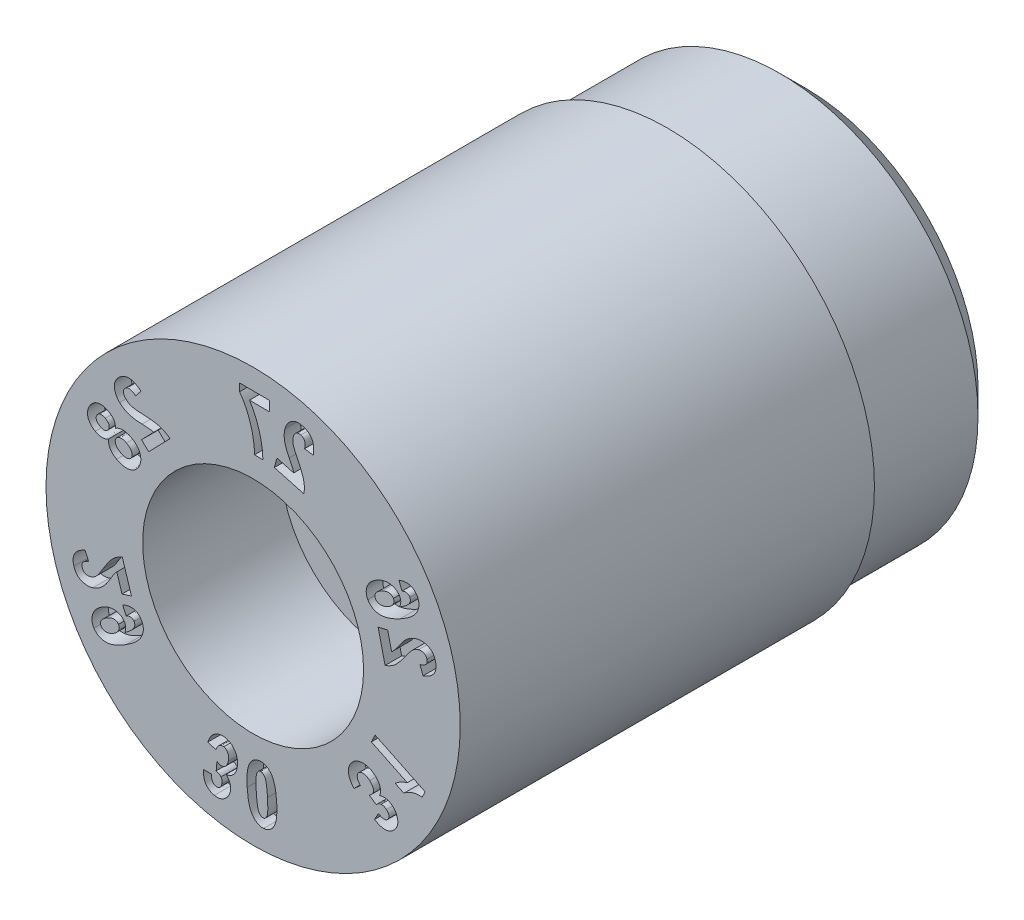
from build123d import *

# Parameters (mm, degrees)
SKETCH5_W          = 1
SKETCH5_H          = 1
CUT_EXTRUDE3_DEPTH = 0.12


with BuildPart() as part:
    # Sketch1 → Revolve1 (revolve)
    with BuildSketch(Plane(origin=(0, 0, 0), x_dir=(0, 0, -1), z_dir=(1, 0, 0)), mode=Mode.PRIVATE) as revolve1_sk:
        Polygon((0, 1.5), (0, 0.8), (1, 0.8), (1, 0.5), (4, 0.5), (4, 1.25), (3.75, 1.5), align=None)
    revolve(revolve1_sk.sketch.rotate(Axis((0, 0, 3.797909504), (0, 0, -1)), 90), axis=Axis((0, 0, 3.797909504), (0, 0, -1)))

    # Sketch5 → Cut-Revolve1 (revolve, cut)
    with BuildSketch(Plane(origin=(0, 0, 0), x_dir=(0, 0, -1), z_dir=(1, 0, 0)), mode=Mode.PRIVATE) as cut_revolve1_sk:
        with Locations((3.5, 1.935)):
            Rectangle(SKETCH5_W, SKETCH5_H)
    revolve(cut_revolve1_sk.sketch.rotate(Axis((0, 0, 0), (0, 0, -1)), 90), axis=Axis((0, 0, 0), (0, 0, -1)), mode=Mode.SUBTRACT)

    # Sketch12 → Cut-Extrude3 (cut)
    # profile 1 of 12: a face of its own
    with BuildSketch(Plane.XY):
        with BuildLine():
            Line((0.974609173, 0.338144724), (0.905148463, 0.321745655))
            Line((0.905148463, 0.321745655), (0.955971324, 0.10664616))
            add(Edge.make_bspline(
                [(0.955971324, 0.10664616), (0.962315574, 0.108938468), (0.9749237, 0.113494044), (0.992944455, 0.122459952), (1.010020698, 0.133080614), (1.023609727, 0.14335984), (1.034378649, 0.152803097), (1.042804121, 0.161254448), (1.051780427, 0.170814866), (1.061181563, 0.181607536), (1.071021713, 0.19360956), (1.081394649, 0.206736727), (1.092033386, 0.221178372), (1.09923475, 0.231232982), (1.102955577, 0.236428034)],
                knots=[0, 0, 0, 0, 1.213893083, 2.412407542, 3.616139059, 4.830628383, 5.475865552, 6.193816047, 6.978445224, 7.837046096, 8.770495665, 9.772985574, 10.849338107, 12, 12, 12, 12], degree=3))
            add(Edge.make_bspline(
                [(1.102955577, 0.236428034), (1.105862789, 0.240524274), (1.111410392, 0.248340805), (1.119537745, 0.259338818), (1.126882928, 0.269197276), (1.133503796, 0.277877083), (1.139508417, 0.28532577), (1.14481139, 0.291570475), (1.149295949, 0.296733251), (1.15224648, 0.299573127), (1.153560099, 0.300837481)],
                knots=[0, 0, 0, 0, 1.470113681, 2.80530214, 4.002305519, 5.068324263, 6.000261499, 6.801944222, 7.466608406, 8, 8, 8, 8], degree=3))
            add(Edge.make_bspline(
                [(1.153560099, 0.300837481), (1.156958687, 0.303909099), (1.16357661, 0.309890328), (1.174586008, 0.317015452), (1.185919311, 0.322676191), (1.193908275, 0.324906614), (1.19787527, 0.326014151)],
                knots=[0, 0, 0, 0, 1.064698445, 2.073241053, 3.043249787, 4, 4, 4, 4], degree=3))
            add(Edge.make_bspline(
                [(1.19787527, 0.326014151), (1.201924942, 0.326825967), (1.209539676, 0.328352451), (1.22062684, 0.328792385), (1.230511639, 0.327364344), (1.239163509, 0.324062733), (1.246461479, 0.319186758), (1.252373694, 0.312932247), (1.256840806, 0.305341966), (1.258458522, 0.299639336), (1.259296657, 0.296684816)],
                knots=[0, 0, 0, 0, 1.286861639, 2.41972907, 3.44296348, 4.380779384, 5.284129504, 6.157128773, 7.045212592, 8, 8, 8, 8], degree=3))
            add(Edge.make_bspline(
                [(1.259296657, 0.296684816), (1.259926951, 0.293416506), (1.261135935, 0.28714747), (1.260086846, 0.277767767), (1.257100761, 0.269079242), (1.251526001, 0.261321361), (1.243938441, 0.25429521), (1.23416358, 0.248073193), (1.222226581, 0.242691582), (1.213417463, 0.239872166), (1.208735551, 0.23837369)],
                knots=[0, 0, 0, 0, 0.918120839, 1.761073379, 2.583477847, 3.439679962, 4.379580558, 5.436722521, 6.637657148, 8, 8, 8, 8], degree=3))
            Line((1.208735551, 0.23837369), (1.230664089, 0.17910678))
            add(Edge.make_bspline(
                [(1.230664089, 0.17910678), (1.23535633, 0.180779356), (1.244438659, 0.184016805), (1.257329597, 0.189580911), (1.26899065, 0.195717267), (1.279676, 0.202077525), (1.289030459, 0.209190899), (1.297418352, 0.216531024), (1.304512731, 0.224475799), (1.310503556, 0.232841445), (1.315380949, 0.241631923), (1.319207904, 0.250799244), (1.322188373, 0.260255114), (1.323991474, 0.270141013), (1.324778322, 0.28036738), (1.324624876, 0.290957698), (1.323321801, 0.301884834), (1.321802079, 0.309205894), (1.321025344, 0.312947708)],
                knots=[0, 0, 0, 0, 1.321152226, 2.557229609, 3.720050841, 4.814888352, 5.850918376, 6.832839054, 7.767048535, 8.669200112, 9.557022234, 10.427296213, 11.300376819, 12.181677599, 13.086309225, 14.017204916, 14.986587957, 16, 16, 16, 16], degree=3))
            add(Edge.make_bspline(
                [(1.321025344, 0.312947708), (1.319970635, 0.317002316), (1.31792302, 0.324873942), (1.313647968, 0.335965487), (1.308582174, 0.346060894), (1.302583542, 0.35510977), (1.295861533, 0.363284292), (1.288120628, 0.370267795), (1.279630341, 0.37632434), (1.270354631, 0.381213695), (1.260658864, 0.385242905), (1.250746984, 0.388342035), (1.240775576, 0.390712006), (1.230644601, 0.392012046), (1.220429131, 0.3926537), (1.210056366, 0.392308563), (1.199609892, 0.391109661), (1.192688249, 0.38963744), (1.189200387, 0.388895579)],
                knots=[0, 0, 0, 0, 1.174391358, 2.279966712, 3.327326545, 4.336455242, 5.319446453, 6.287707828, 7.252005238, 8.237483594, 9.22202635, 10.193494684, 11.147734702, 12.092877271, 13.054932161, 14.015938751, 15.000218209, 16, 16, 16, 16], degree=3))
            add(Edge.make_bspline(
                [(1.189200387, 0.388895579), (1.185251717, 0.387862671), (1.177422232, 0.385814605), (1.165949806, 0.381834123), (1.154895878, 0.377010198), (1.144126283, 0.371496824), (1.133693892, 0.365071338), (1.123462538, 0.357809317), (1.113457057, 0.34956034), (1.105181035, 0.342093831), (1.098521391, 0.335394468), (1.093233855, 0.329675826), (1.087714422, 0.323283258), (1.081960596, 0.316220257), (1.075962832, 0.308480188), (1.069549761, 0.300174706), (1.063061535, 0.29106488), (1.058616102, 0.284795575), (1.056326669, 0.281566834)],
                knots=[0, 0, 0, 0, 1.117855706, 2.216501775, 3.322499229, 4.419593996, 5.528196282, 6.676118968, 7.853924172, 9.078742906, 9.728012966, 10.441119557, 11.211980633, 12.041344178, 12.936494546, 13.894495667, 14.915648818, 16, 16, 16, 16], degree=3))
            add(Edge.make_bspline(
                [(1.056326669, 0.281566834), (1.054253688, 0.278584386), (1.050294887, 0.272888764), (1.044453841, 0.264877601), (1.039345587, 0.257549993), (1.034662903, 0.251153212), (1.030498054, 0.245640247), (1.026938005, 0.240928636), (1.023894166, 0.237070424), (1.01931627, 0.231391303), (1.012798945, 0.224259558), (1.006489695, 0.218819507), (1.003470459, 0.216216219)],
                knots=[0, 0, 0, 0, 1.292399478, 2.468114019, 3.527722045, 4.470738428, 5.288803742, 5.986325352, 6.572030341, 7.037354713, 8.582251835, 10, 10, 10, 10], degree=3))
            Line((1.003470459, 0.216216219), (0.974609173, 0.338144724))
        make_face()
    # profile 2 of 12: a face of its own
    with BuildSketch(Plane.XY):
        with BuildLine():
            Line((1.056506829, 0.691760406), (1.078304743, 0.634097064))
            add(Edge.make_bspline(
                [(1.078304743, 0.634097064), (1.081600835, 0.635393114), (1.087821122, 0.637838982), (1.097035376, 0.640145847), (1.105446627, 0.641085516), (1.113093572, 0.640628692), (1.119929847, 0.638576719), (1.125899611, 0.635053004), (1.131045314, 0.630097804), (1.133548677, 0.625970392), (1.134848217, 0.623827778)],
                knots=[0, 0, 0, 0, 1.326352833, 2.503053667, 3.548282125, 4.487880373, 5.35425991, 6.196873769, 7.063965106, 8, 8, 8, 8], degree=3))
            add(Edge.make_bspline(
                [(1.134848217, 0.623827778), (1.135584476, 0.622329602), (1.137049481, 0.619348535), (1.138369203, 0.614550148), (1.138971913, 0.6096252), (1.138882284, 0.604582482), (1.138138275, 0.599382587), (1.136568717, 0.594067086), (1.134225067, 0.58863096), (1.131208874, 0.582915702), (1.127072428, 0.576924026), (1.121508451, 0.570714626), (1.114694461, 0.564018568), (1.106414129, 0.556989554), (1.096746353, 0.549541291), (1.085640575, 0.541682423), (1.073137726, 0.533416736), (1.064254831, 0.527904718), (1.059625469, 0.525032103)],
                knots=[0, 0, 0, 0, 0.58938028, 1.172747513, 1.749880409, 2.339260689, 2.951505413, 3.60232415, 4.293077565, 5.042524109, 5.884886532, 6.860680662, 7.986915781, 9.262003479, 10.699549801, 12.302517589, 14.073039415, 16, 16, 16, 16], degree=3))
            add(Edge.make_bspline(
                [(1.059625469, 0.525032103), (1.061069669, 0.528047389), (1.063867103, 0.533888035), (1.066885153, 0.542867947), (1.068873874, 0.551616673), (1.069700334, 0.560203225), (1.069434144, 0.568599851), (1.068099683, 0.576840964), (1.065534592, 0.584894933), (1.063022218, 0.589969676), (1.061748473, 0.592542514)],
                knots=[0, 0, 0, 0, 1.137901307, 2.204129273, 3.21914152, 4.187914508, 5.133932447, 6.073147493, 7.023107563, 8, 8, 8, 8], degree=3))
            add(Edge.make_bspline(
                [(1.061748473, 0.592542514), (1.060168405, 0.59529825), (1.057032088, 0.600768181), (1.050996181, 0.608000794), (1.044333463, 0.614588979), (1.036749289, 0.620343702), (1.028249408, 0.625144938), (1.018983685, 0.629300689), (1.008832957, 0.63244287), (0.997998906, 0.634948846), (0.986589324, 0.636444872), (0.974852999, 0.636713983), (0.962890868, 0.635950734), (0.950713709, 0.634000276), (0.938354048, 0.630764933), (0.925729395, 0.626553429), (0.912884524, 0.621197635), (0.90446209, 0.616824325), (0.900156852, 0.614588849)],
                knots=[0, 0, 0, 0, 0.840593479, 1.668515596, 2.487158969, 3.32111705, 4.183251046, 5.069946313, 6.00786811, 6.99506364, 8.015139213, 9.052144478, 10.102163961, 11.188660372, 12.315686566, 13.485116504, 14.714484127, 16, 16, 16, 16], degree=3))
            add(Edge.make_bspline(
                [(0.900156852, 0.614588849), (0.89567402, 0.612065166), (0.886920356, 0.607137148), (0.874770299, 0.598886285), (0.863730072, 0.590320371), (0.853876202, 0.58130683), (0.845286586, 0.571754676), (0.837867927, 0.561801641), (0.831608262, 0.55145236), (0.826751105, 0.540673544), (0.822964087, 0.529815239), (0.820451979, 0.518983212), (0.819095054, 0.508296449), (0.81899804, 0.497711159), (0.820118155, 0.487240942), (0.822457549, 0.476933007), (0.825961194, 0.466756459), (0.829198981, 0.460284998), (0.830846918, 0.456991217)],
                knots=[0, 0, 0, 0, 1.28002457, 2.49951519, 3.651689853, 4.755862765, 5.818827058, 6.844285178, 7.841830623, 8.82287142, 9.781676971, 10.699986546, 11.585482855, 12.457898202, 13.328830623, 14.200413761, 15.084064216, 16, 16, 16, 16], degree=3))
            add(Edge.make_bspline(
                [(0.830846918, 0.456991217), (0.832869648, 0.453496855), (0.836854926, 0.446612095), (0.844483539, 0.437523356), (0.852967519, 0.429451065), (0.862583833, 0.422605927), (0.873201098, 0.416891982), (0.884941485, 0.412554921), (0.897617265, 0.409200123), (0.911376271, 0.407037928), (0.926282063, 0.40634082), (0.94238761, 0.40762905), (0.959694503, 0.410628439), (0.978201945, 0.415493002), (0.997870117, 0.422177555), (1.018762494, 0.430638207), (1.040871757, 0.440867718), (1.055797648, 0.44872635), (1.063528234, 0.452796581)],
                knots=[0, 0, 0, 0, 0.745134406, 1.468099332, 2.184337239, 2.905205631, 3.643323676, 4.406634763, 5.213288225, 6.063943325, 6.976638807, 7.965013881, 9.044417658, 10.219974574, 11.498735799, 12.88207178, 14.385127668, 16, 16, 16, 16], degree=3))
            add(Edge.make_bspline(
                [(1.063528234, 0.452796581), (1.071289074, 0.457117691), (1.086242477, 0.465443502), (1.10728828, 0.478489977), (1.126133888, 0.491583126), (1.142760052, 0.504730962), (1.157204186, 0.517896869), (1.1694999, 0.531025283), (1.17961215, 0.54420863), (1.187436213, 0.557480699), (1.193275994, 0.570661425), (1.197676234, 0.583574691), (1.200254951, 0.596385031), (1.201346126, 0.608954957), (1.20071227, 0.62136813), (1.198467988, 0.633552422), (1.194565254, 0.645582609), (1.190774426, 0.653181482), (1.188841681, 0.657055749)],
                knots=[0, 0, 0, 0, 1.590291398, 3.064135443, 4.431500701, 5.696881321, 6.856555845, 7.927737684, 8.913486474, 9.825276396, 10.679045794, 11.491013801, 12.262855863, 13.012908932, 13.744477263, 14.4811604, 15.225623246, 16, 16, 16, 16], degree=3))
            add(Edge.make_bspline(
                [(1.188841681, 0.657055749), (1.187358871, 0.659638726), (1.184434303, 0.664733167), (1.179325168, 0.671766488), (1.173683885, 0.678095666), (1.167577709, 0.683798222), (1.160859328, 0.688737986), (1.153692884, 0.693089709), (1.145952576, 0.696637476), (1.137796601, 0.699581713), (1.129139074, 0.701769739), (1.120001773, 0.702901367), (1.110470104, 0.703374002), (1.100494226, 0.702770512), (1.090084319, 0.701375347), (1.079244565, 0.698979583), (1.067923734, 0.695933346), (1.06038682, 0.693178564), (1.056506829, 0.691760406)],
                knots=[0, 0, 0, 0, 0.944753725, 1.863350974, 2.752789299, 3.632265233, 4.509642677, 5.394759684, 6.288539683, 7.207016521, 8.143933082, 9.115619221, 10.124387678, 11.168605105, 12.282554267, 13.454437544, 14.689548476, 16, 16, 16, 16], degree=3))
        make_face()
        with BuildLine():
            add(Edge.make_bspline(
                [(0.976542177, 0.486508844), (0.973823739, 0.485064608), (0.968546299, 0.482260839), (0.960559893, 0.478733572), (0.952866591, 0.475827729), (0.94546517, 0.473561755), (0.938352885, 0.471951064), (0.93151051, 0.470963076), (0.924924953, 0.470696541), (0.918692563, 0.471119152), (0.91287374, 0.47199538), (0.907517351, 0.473359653), (0.902640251, 0.475089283), (0.898187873, 0.477172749), (0.894261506, 0.479717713), (0.890893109, 0.482769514), (0.887898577, 0.486101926), (0.886401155, 0.488686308), (0.885652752, 0.489977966)],
                knots=[0, 0, 0, 0, 1.472424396, 2.858491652, 4.173838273, 5.405355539, 6.558879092, 7.659772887, 8.708671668, 9.705805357, 10.644326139, 11.520416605, 12.346188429, 13.1169576, 13.867792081, 14.574474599, 15.287531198, 16, 16, 16, 16], degree=3))
            add(Edge.make_bspline(
                [(0.885652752, 0.489977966), (0.884466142, 0.492548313), (0.882112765, 0.497646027), (0.881279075, 0.506233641), (0.88277328, 0.515000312), (0.885579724, 0.522370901), (0.889069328, 0.528278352), (0.892589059, 0.532792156), (0.896756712, 0.53741778), (0.901806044, 0.541897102), (0.907513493, 0.546466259), (0.914019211, 0.550958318), (0.921229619, 0.555522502), (0.926414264, 0.558355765), (0.929091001, 0.559818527)],
                knots=[0, 0, 0, 0, 1.104721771, 2.190970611, 3.321914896, 4.571494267, 5.262392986, 6.007540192, 6.814012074, 7.702496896, 8.652725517, 9.681950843, 10.803234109, 12, 12, 12, 12], degree=3))
            add(Edge.make_bspline(
                [(0.929091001, 0.559818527), (0.931905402, 0.561287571), (0.937348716, 0.56412884), (0.945409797, 0.567905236), (0.953137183, 0.570892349), (0.960389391, 0.573351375), (0.96730065, 0.575005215), (0.973779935, 0.576105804), (0.979892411, 0.576529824), (0.987260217, 0.576115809), (0.995637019, 0.574489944), (1.004357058, 0.570504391), (1.011621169, 0.564815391), (1.014834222, 0.559760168), (1.016461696, 0.5571996)],
                knots=[0, 0, 0, 0, 1.174568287, 2.271724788, 3.291095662, 4.238475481, 5.102489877, 5.917261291, 6.668026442, 7.363357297, 8.644115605, 9.797897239, 10.884592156, 12, 12, 12, 12], degree=3))
            add(Edge.make_bspline(
                [(1.016461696, 0.5571996), (1.017671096, 0.554516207), (1.020070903, 0.549191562), (1.020984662, 0.540255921), (1.019516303, 0.531051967), (1.016652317, 0.52331471), (1.013218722, 0.517117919), (1.009918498, 0.512423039), (1.006018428, 0.507793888), (1.001409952, 0.503309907), (0.996088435, 0.499031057), (0.990245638, 0.494660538), (0.983686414, 0.490427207), (0.978972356, 0.487841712), (0.976542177, 0.486508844)],
                knots=[0, 0, 0, 0, 1.166869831, 2.3154148, 3.516501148, 4.855563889, 5.579948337, 6.334977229, 7.138704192, 7.988889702, 8.892563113, 9.857934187, 10.89572794, 12, 12, 12, 12], degree=3))
        make_face(mode=Mode.SUBTRACT)
    # profile 3 of 12: a face of its own
    with BuildSketch(Plane.XY):
        with BuildLine():
            Line((0.172749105, 1.016157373), (0.153950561, 0.947090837))
            Line((0.153950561, 0.947090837), (0.367769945, 0.888780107))
            add(Edge.make_bspline(
                [(0.367769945, 0.888780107), (0.368765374, 0.895445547), (0.370750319, 0.908736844), (0.371588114, 0.928892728), (0.370354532, 0.949013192), (0.367915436, 0.965922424), (0.364675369, 0.979881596), (0.361418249, 0.991389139), (0.357210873, 1.003829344), (0.352353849, 1.017313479), (0.346412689, 1.031701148), (0.339720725, 1.047073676), (0.332288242, 1.063492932), (0.32680496, 1.074629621), (0.323970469, 1.080386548)],
                knots=[0, 0, 0, 0, 1.210069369, 2.412952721, 3.615502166, 4.82714206, 5.476780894, 6.188607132, 6.974637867, 7.835419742, 8.76278535, 9.770198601, 10.847340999, 12, 12, 12, 12], degree=3))
            add(Edge.make_bspline(
                [(0.323970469, 1.080386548), (0.321755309, 1.084900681), (0.317520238, 1.093531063), (0.311736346, 1.105978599), (0.306478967, 1.117174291), (0.302092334, 1.127218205), (0.298322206, 1.136056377), (0.295342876, 1.143701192), (0.292943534, 1.150141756), (0.291845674, 1.154101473), (0.291354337, 1.155873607)],
                knots=[0, 0, 0, 0, 1.465934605, 2.802658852, 4.001571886, 5.071710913, 5.997882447, 6.802507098, 7.46407355, 8, 8, 8, 8], degree=3))
            add(Edge.make_bspline(
                [(0.291354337, 1.155873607), (0.290317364, 1.160335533), (0.28829312, 1.169045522), (0.287165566, 1.182144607), (0.287685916, 1.194846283), (0.289543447, 1.202944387), (0.290465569, 1.206964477)],
                knots=[0, 0, 0, 0, 1.062559, 2.074189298, 3.043981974, 4, 4, 4, 4], degree=3))
            add(Edge.make_bspline(
                [(0.290465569, 1.206964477), (0.291670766, 1.210919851), (0.293945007, 1.218383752), (0.298935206, 1.228316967), (0.304935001, 1.236378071), (0.312011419, 1.242380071), (0.31980578, 1.246486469), (0.328124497, 1.24875722), (0.336943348, 1.248955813), (0.342734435, 1.247710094), (0.345723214, 1.247067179)],
                knots=[0, 0, 0, 0, 1.28476136, 2.424380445, 3.440518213, 4.39092087, 5.286063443, 6.16131014, 7.051052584, 8, 8, 8, 8], degree=3))
            add(Edge.make_bspline(
                [(0.345723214, 1.247067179), (0.348878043, 1.246048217), (0.354959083, 1.244084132), (0.36276752, 1.238725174), (0.368881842, 1.231828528), (0.373135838, 1.223284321), (0.375711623, 1.213249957), (0.37643714, 1.201682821), (0.375554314, 1.188579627), (0.373799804, 1.179463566), (0.372864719, 1.174605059)],
                knots=[0, 0, 0, 0, 0.9133889, 1.760588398, 2.584612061, 3.438533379, 4.375699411, 5.433141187, 6.631963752, 8, 8, 8, 8], degree=3))
            Line((0.372864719, 1.174605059), (0.435531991, 1.165460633))
            add(Edge.make_bspline(
                [(0.435531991, 1.165460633), (0.436340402, 1.170381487), (0.43790826, 1.179925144), (0.438993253, 1.193962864), (0.439374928, 1.207175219), (0.438694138, 1.219603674), (0.437098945, 1.231252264), (0.434575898, 1.2421349), (0.431056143, 1.252219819), (0.426492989, 1.261448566), (0.421122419, 1.269939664), (0.415000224, 1.277767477), (0.407995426, 1.284865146), (0.400175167, 1.291190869), (0.391530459, 1.296760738), (0.382148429, 1.301674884), (0.371915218, 1.305851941), (0.364723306, 1.308020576), (0.3610463, 1.309129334)],
                knots=[0, 0, 0, 0, 1.31934614, 2.558781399, 3.72329237, 4.815771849, 5.849220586, 6.831661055, 7.767858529, 8.669737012, 9.550469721, 10.42301211, 11.294937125, 12.184159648, 13.079789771, 14.012529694, 14.983866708, 16, 16, 16, 16], degree=3))
            add(Edge.make_bspline(
                [(0.3610463, 1.309129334), (0.356971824, 1.31012487), (0.349057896, 1.312058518), (0.337208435, 1.313689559), (0.325846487, 1.314030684), (0.314952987, 1.313180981), (0.304603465, 1.311032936), (0.294700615, 1.3077384), (0.2853492, 1.303083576), (0.276581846, 1.297289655), (0.268458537, 1.290624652), (0.260863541, 1.283507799), (0.254118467, 1.275725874), (0.247990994, 1.267542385), (0.242608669, 1.258794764), (0.238003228, 1.249505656), (0.233915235, 1.239761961), (0.231944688, 1.23293376), (0.230946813, 1.229475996)],
                knots=[0, 0, 0, 0, 1.172560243, 2.27748495, 3.338117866, 4.346241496, 5.326166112, 6.287328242, 7.257149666, 8.238709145, 9.220122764, 10.193097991, 11.14609311, 12.096350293, 13.049856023, 14.013873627, 14.994236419, 16, 16, 16, 16], degree=3))
            add(Edge.make_bspline(
                [(0.230946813, 1.229475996), (0.229933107, 1.225511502), (0.227914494, 1.217616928), (0.226025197, 1.205598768), (0.224920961, 1.193543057), (0.224755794, 1.181417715), (0.225294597, 1.169106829), (0.226902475, 1.15661095), (0.229281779, 1.143836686), (0.231947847, 1.132988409), (0.234640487, 1.123913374), (0.237184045, 1.11655831), (0.24017007, 1.108645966), (0.243516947, 1.100154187), (0.247532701, 1.091155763), (0.251794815, 1.081526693), (0.25663072, 1.07141783), (0.26002989, 1.064525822), (0.261779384, 1.060978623)],
                knots=[0, 0, 0, 0, 1.117348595, 2.224998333, 3.319174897, 4.422104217, 5.535264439, 6.682717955, 7.860643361, 9.083646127, 9.732491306, 10.446057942, 11.209092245, 12.042847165, 12.93903701, 13.90062918, 14.919489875, 16, 16, 16, 16], degree=3))
            add(Edge.make_bspline(
                [(0.261779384, 1.060978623), (0.263395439, 1.057691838), (0.266471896, 1.05143484), (0.270886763, 1.042524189), (0.274748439, 1.034463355), (0.278194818, 1.027302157), (0.281079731, 1.020988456), (0.283564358, 1.015621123), (0.28550007, 1.011107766), (0.288274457, 1.004375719), (0.291343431, 0.995177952), (0.293126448, 0.987011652), (0.293983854, 0.983084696)],
                knots=[0, 0, 0, 0, 1.299480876, 2.473800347, 3.528171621, 4.4706826, 5.293386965, 5.990986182, 6.569031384, 7.03557027, 8.574484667, 10, 10, 10, 10], degree=3))
            Line((0.293983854, 0.983084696), (0.172749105, 1.016157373))
        make_face()
    # profile 4 of 12: a face of its own
    with BuildSketch(Plane.XY):
        with BuildLine():
            Line((0.117479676, 1.278677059), (0.118048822, 1.350186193))
            Line((0.118048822, 1.350186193), (-0.097777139, 1.351912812))
            Line((-0.097777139, 1.351912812), (-0.098196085, 1.296068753))
            add(Edge.make_bspline(
                [(-0.098196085, 1.296068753), (-0.095961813, 1.293271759), (-0.091345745, 1.287493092), (-0.084803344, 1.278110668), (-0.078196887, 1.267907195), (-0.071563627, 1.256871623), (-0.064924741, 1.244993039), (-0.058292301, 1.232266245), (-0.051606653, 1.218721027), (-0.042656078, 1.199472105), (-0.032106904, 1.174376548), (-0.021059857, 1.143108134), (-0.011439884, 1.110823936), (-0.004891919, 1.083256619), (-0.000501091, 1.061055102), (0.002447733, 1.044727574), (0.004889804, 1.028775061), (0.006868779, 1.013237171), (0.008328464, 0.998105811), (0.009441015, 0.983369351), (0.010066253, 0.969010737), (0.010081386, 0.959558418), (0.010088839, 0.954903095)],
                knots=[0, 0, 0, 0, 0.590703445, 1.220409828, 1.886735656, 2.596758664, 3.345068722, 4.132337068, 4.965147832, 5.837943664, 7.635749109, 9.455636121, 11.308663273, 13.193195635, 14.12948282, 15.043798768, 15.931366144, 16.792766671, 17.628636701, 18.440053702, 19.231717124, 20, 20, 20, 20], degree=3))
            Line((0.010088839, 0.954903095), (0.070884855, 0.954492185))
            add(Edge.make_bspline(
                [(0.070884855, 0.954492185), (0.070698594, 0.961615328), (0.070325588, 0.975880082), (0.068676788, 0.997228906), (0.066524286, 1.018605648), (0.06352105, 1.039964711), (0.059629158, 1.061305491), (0.055212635, 1.082676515), (0.049875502, 1.104016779), (0.043917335, 1.125322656), (0.037149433, 1.146318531), (0.029951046, 1.166958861), (0.02198528, 1.187010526), (0.01366745, 1.206662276), (0.004533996, 1.225688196), (-0.004951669, 1.244304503), (-0.015188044, 1.262312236), (-0.022422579, 1.274001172), (-0.026025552, 1.279822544)],
                knots=[0, 0, 0, 0, 0.995363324, 1.993307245, 2.990585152, 3.996742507, 5.005700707, 6.020870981, 7.045009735, 8.078336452, 9.111123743, 10.12649105, 11.131703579, 12.124990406, 13.107174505, 14.079533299, 15.043561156, 16, 16, 16, 16], degree=3))
            Line((-0.026025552, 1.279822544), (0.117479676, 1.278677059))
        make_face()
    # profile 5 of 12: a face of its own
    with BuildSketch(Plane.XY):
        with BuildLine():
            Line((-0.807880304, 0.640630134), (-0.756311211, 0.590751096))
            Line((-0.756311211, 0.590751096), (-0.601906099, 0.750269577))
            add(Edge.make_bspline(
                [(-0.601906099, 0.750269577), (-0.607248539, 0.754373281), (-0.617928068, 0.762576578), (-0.635268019, 0.7729541), (-0.653508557, 0.781693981), (-0.669553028, 0.787708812), (-0.683418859, 0.7915747), (-0.695128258, 0.794235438), (-0.708077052, 0.796604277), (-0.722284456, 0.798729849), (-0.737758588, 0.800565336), (-0.7544918, 0.802164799), (-0.772500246, 0.803355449), (-0.784918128, 0.804000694), (-0.791340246, 0.804334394)],
                knots=[0, 0, 0, 0, 1.206524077, 2.411839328, 3.613207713, 4.827888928, 5.476720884, 6.191751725, 6.979160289, 7.835320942, 8.765871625, 9.771505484, 10.847496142, 12, 12, 12, 12], degree=3))
            add(Edge.make_bspline(
                [(-0.791340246, 0.804334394), (-0.796380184, 0.804596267), (-0.805975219, 0.805094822), (-0.819686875, 0.805945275), (-0.831993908, 0.806802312), (-0.842950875, 0.807693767), (-0.852510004, 0.808650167), (-0.860663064, 0.809841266), (-0.86746082, 0.8107994), (-0.871473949, 0.811737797), (-0.873263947, 0.812156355)],
                knots=[0, 0, 0, 0, 1.470216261, 2.798997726, 4.002146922, 5.06409618, 6.001667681, 6.799902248, 7.464713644, 8, 8, 8, 8], degree=3))
            add(Edge.make_bspline(
                [(-0.873263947, 0.812156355), (-0.877692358, 0.81337668), (-0.886316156, 0.815753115), (-0.898272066, 0.821247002), (-0.909210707, 0.827763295), (-0.915423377, 0.833338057), (-0.918512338, 0.836109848)],
                knots=[0, 0, 0, 0, 1.062837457, 2.069748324, 3.040272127, 4, 4, 4, 4], degree=3))
            add(Edge.make_bspline(
                [(-0.918512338, 0.836109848), (-0.921403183, 0.839082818), (-0.926845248, 0.844679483), (-0.933190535, 0.853831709), (-0.937402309, 0.862974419), (-0.939222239, 0.872075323), (-0.939160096, 0.880884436), (-0.936959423, 0.889206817), (-0.932990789, 0.897092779), (-0.929064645, 0.90156399), (-0.92703009, 0.903881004)],
                knots=[0, 0, 0, 0, 1.286912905, 2.422634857, 3.443904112, 4.392236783, 5.284134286, 6.157286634, 7.04509257, 8, 8, 8, 8], degree=3))
            add(Edge.make_bspline(
                [(-0.92703009, 0.903881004), (-0.924600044, 0.906144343), (-0.919912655, 0.91051017), (-0.911478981, 0.914863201), (-0.902443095, 0.916918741), (-0.892850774, 0.916538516), (-0.882819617, 0.913816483), (-0.872298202, 0.908919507), (-0.861212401, 0.901824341), (-0.854046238, 0.895871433), (-0.850230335, 0.892701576)],
                knots=[0, 0, 0, 0, 0.912656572, 1.760451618, 2.583037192, 3.44247971, 4.380508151, 5.432007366, 6.632572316, 8, 8, 8, 8], degree=3))
            Line((-0.850230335, 0.892701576), (-0.812104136, 0.943368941))
            add(Edge.make_bspline(
                [(-0.812104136, 0.943368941), (-0.816061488, 0.946410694), (-0.823745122, 0.952316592), (-0.835424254, 0.960206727), (-0.846896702, 0.966850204), (-0.858162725, 0.972204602), (-0.869125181, 0.976524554), (-0.879914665, 0.979487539), (-0.890455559, 0.981245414), (-0.900764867, 0.98176332), (-0.910822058, 0.981126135), (-0.920643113, 0.979462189), (-0.930242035, 0.976704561), (-0.939606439, 0.972920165), (-0.948719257, 0.968059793), (-0.95754988, 0.962141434), (-0.966146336, 0.955182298), (-0.971495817, 0.949901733), (-0.974236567, 0.947196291)],
                knots=[0, 0, 0, 0, 1.317995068, 2.559032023, 3.719552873, 4.815655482, 5.850686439, 6.827365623, 7.764968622, 8.667611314, 9.547249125, 10.421384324, 11.293179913, 12.179698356, 13.084064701, 14.015740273, 14.983385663, 16, 16, 16, 16], degree=3))
            add(Edge.make_bspline(
                [(-0.974236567, 0.947196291), (-0.97706908, 0.94412815), (-0.982597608, 0.93813972), (-0.989708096, 0.928565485), (-0.995506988, 0.918789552), (-0.999954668, 0.908830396), (-1.003099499, 0.898708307), (-1.004964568, 0.88844434), (-1.005345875, 0.878006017), (-1.004523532, 0.867522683), (-1.002670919, 0.857131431), (-0.999911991, 0.847052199), (-0.996456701, 0.837312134), (-0.992197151, 0.827968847), (-0.987090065, 0.819019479), (-0.981218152, 0.810446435), (-0.974521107, 0.802250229), (-0.969518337, 0.797197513), (-0.966984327, 0.794638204)],
                knots=[0, 0, 0, 0, 1.165815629, 2.275450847, 3.324136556, 4.335020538, 5.314916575, 6.278352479, 7.240097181, 8.224036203, 9.210642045, 10.183987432, 11.139983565, 12.094664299, 13.048297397, 14.014663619, 14.994384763, 16, 16, 16, 16], degree=3))
            add(Edge.make_bspline(
                [(-0.966984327, 0.794638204), (-0.963994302, 0.791835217), (-0.958055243, 0.786267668), (-0.948373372, 0.77889974), (-0.938404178, 0.772032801), (-0.927832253, 0.766046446), (-0.916782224, 0.760625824), (-0.905096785, 0.755908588), (-0.892729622, 0.751908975), (-0.881897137, 0.749031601), (-0.872656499, 0.74695952), (-0.864960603, 0.745588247), (-0.856560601, 0.744416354), (-0.847468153, 0.743324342), (-0.837680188, 0.742296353), (-0.827185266, 0.741477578), (-0.815989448, 0.740848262), (-0.80829216, 0.740501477), (-0.804336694, 0.740323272)],
                knots=[0, 0, 0, 0, 1.117891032, 2.220456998, 3.316698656, 4.419783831, 5.532810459, 6.674091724, 7.855866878, 9.078177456, 9.731917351, 10.440112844, 11.211022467, 12.046500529, 12.93955511, 13.897000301, 14.919314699, 16, 16, 16, 16], degree=3))
            add(Edge.make_bspline(
                [(-0.804336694, 0.740323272), (-0.800679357, 0.740165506), (-0.793688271, 0.739863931), (-0.783721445, 0.739319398), (-0.774777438, 0.738890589), (-0.766837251, 0.738411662), (-0.759901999, 0.737894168), (-0.753960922, 0.737482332), (-0.749049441, 0.737030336), (-0.741804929, 0.736113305), (-0.732228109, 0.734583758), (-0.724199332, 0.732217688), (-0.720352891, 0.731084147)],
                knots=[0, 0, 0, 0, 1.296020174, 2.477373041, 3.533833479, 4.466140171, 5.29348098, 5.995947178, 6.574578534, 7.039228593, 8.581548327, 10, 10, 10, 10], degree=3))
            Line((-0.720352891, 0.731084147), (-0.807880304, 0.640630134))
        make_face()
    # profile 6 of 12: a face of its own
    with BuildSketch(Plane.XY):
        with BuildLine():
            add(Edge.make_bspline(
                [(-0.996812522, 0.617390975), (-0.996859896, 0.621647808), (-0.996952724, 0.629988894), (-0.999040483, 0.642145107), (-1.002831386, 0.653562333), (-1.008324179, 0.664193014), (-1.015452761, 0.674112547), (-1.024371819, 0.68309831), (-1.034734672, 0.69155303), (-1.042632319, 0.696185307), (-1.046708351, 0.698576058)],
                knots=[0, 0, 0, 0, 1.01287438, 1.984685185, 2.924267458, 3.86790823, 4.824403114, 5.821967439, 6.875901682, 8, 8, 8, 8], degree=3))
            add(Edge.make_bspline(
                [(-1.046708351, 0.698576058), (-1.050098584, 0.700378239), (-1.056739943, 0.703908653), (-1.066959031, 0.708100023), (-1.077064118, 0.711328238), (-1.087060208, 0.713497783), (-1.096935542, 0.71464046), (-1.106664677, 0.714700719), (-1.116280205, 0.71379987), (-1.125736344, 0.711906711), (-1.134886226, 0.708954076), (-1.143602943, 0.705049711), (-1.151839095, 0.700196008), (-1.159542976, 0.694358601), (-1.166875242, 0.687737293), (-1.173501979, 0.679985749), (-1.179891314, 0.671511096), (-1.183477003, 0.665232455), (-1.185309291, 0.662024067)],
                knots=[0, 0, 0, 0, 1.137342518, 2.228017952, 3.268270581, 4.277812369, 5.25469244, 6.209233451, 7.155995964, 8.112387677, 9.061490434, 9.999416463, 10.937753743, 11.888075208, 12.859972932, 13.859271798, 14.906086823, 16, 16, 16, 16], degree=3))
            add(Edge.make_bspline(
                [(-1.185309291, 0.662024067), (-1.187130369, 0.658560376), (-1.190661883, 0.651843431), (-1.19484257, 0.641542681), (-1.197646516, 0.63135443), (-1.199510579, 0.621392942), (-1.200157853, 0.611587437), (-1.199525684, 0.601971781), (-1.197756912, 0.592507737), (-1.1948054, 0.583272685), (-1.190934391, 0.574381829), (-1.186336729, 0.565918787), (-1.180962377, 0.557963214), (-1.174880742, 0.550500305), (-1.167986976, 0.543553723), (-1.160402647, 0.537086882), (-1.15207106, 0.53109434), (-1.146074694, 0.527640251), (-1.1430321, 0.525887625)],
                knots=[0, 0, 0, 0, 1.167395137, 2.26386526, 3.309419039, 4.315864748, 5.283575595, 6.233472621, 7.184158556, 8.149576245, 9.120145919, 10.074117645, 11.019646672, 11.981105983, 12.942734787, 13.935977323, 14.952701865, 16, 16, 16, 16], degree=3))
            add(Edge.make_bspline(
                [(-1.1430321, 0.525887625), (-1.138822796, 0.523685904), (-1.130657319, 0.519414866), (-1.117838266, 0.515116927), (-1.105228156, 0.512426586), (-1.092758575, 0.511638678), (-1.080681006, 0.512600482), (-1.069076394, 0.515037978), (-1.058029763, 0.519134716), (-1.051318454, 0.523156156), (-1.047944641, 0.525177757)],
                knots=[0, 0, 0, 0, 1.137546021, 2.206684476, 3.230262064, 4.222091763, 5.19125298, 6.126979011, 7.05842149, 8, 8, 8, 8], degree=3))
            add(Edge.make_bspline(
                [(-1.047944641, 0.525177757), (-1.04804376, 0.520097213), (-1.048237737, 0.510154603), (-1.045766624, 0.495655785), (-1.041459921, 0.482016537), (-1.03486837, 0.469328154), (-1.026243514, 0.457518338), (-1.01551873, 0.446582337), (-1.002700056, 0.436511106), (-0.993051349, 0.430804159), (-0.988048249, 0.427844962)],
                knots=[0, 0, 0, 0, 1.004195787, 1.965208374, 2.896833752, 3.826238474, 4.782761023, 5.782201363, 6.850014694, 8, 8, 8, 8], degree=3))
            add(Edge.make_bspline(
                [(-0.988048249, 0.427844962), (-0.982696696, 0.425078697), (-0.972240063, 0.419673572), (-0.956054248, 0.413673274), (-0.93996497, 0.409714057), (-0.924120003, 0.407865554), (-0.908725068, 0.407902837), (-0.894006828, 0.409947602), (-0.880114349, 0.414040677), (-0.867154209, 0.420113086), (-0.855205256, 0.427849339), (-0.844631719, 0.437424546), (-0.835159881, 0.448414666), (-0.830141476, 0.456785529), (-0.827586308, 0.461047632)],
                knots=[0, 0, 0, 0, 1.178775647, 2.303261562, 3.37093677, 4.415973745, 5.419061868, 6.377680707, 7.315834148, 8.243744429, 9.171261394, 10.091974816, 11.028511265, 12, 12, 12, 12], degree=3))
            add(Edge.make_bspline(
                [(-0.827586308, 0.461047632), (-0.825776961, 0.464493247), (-0.822225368, 0.471256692), (-0.818191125, 0.481807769), (-0.815267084, 0.492378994), (-0.813568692, 0.503027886), (-0.812936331, 0.513726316), (-0.813516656, 0.524489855), (-0.815268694, 0.535292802), (-0.818184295, 0.546017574), (-0.822118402, 0.55657382), (-0.827312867, 0.566640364), (-0.833442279, 0.576291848), (-0.840878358, 0.585272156), (-0.849265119, 0.593829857), (-0.858738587, 0.601933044), (-0.869377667, 0.609419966), (-0.877031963, 0.613897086), (-0.880950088, 0.61618886)],
                knots=[0, 0, 0, 0, 1.012367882, 1.987190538, 2.93392512, 3.862887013, 4.788987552, 5.718723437, 6.66307088, 7.63250992, 8.6077396, 9.589812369, 10.576093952, 11.57816822, 12.618687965, 13.692269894, 14.818705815, 16, 16, 16, 16], degree=3))
            add(Edge.make_bspline(
                [(-0.880950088, 0.61618886), (-0.886142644, 0.618872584), (-0.896193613, 0.624067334), (-0.911799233, 0.629557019), (-0.92709841, 0.632984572), (-0.942134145, 0.634282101), (-0.956756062, 0.633230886), (-0.970851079, 0.630225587), (-0.984362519, 0.624970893), (-0.992621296, 0.619942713), (-0.996812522, 0.617390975)],
                knots=[0, 0, 0, 0, 1.146409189, 2.219046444, 3.237094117, 4.217717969, 5.170438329, 6.10446582, 7.038040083, 8, 8, 8, 8], degree=3))
        make_face()
        with BuildLine():
            add(Edge.make_bspline(
                [(-1.070837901, 0.643685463), (-1.067651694, 0.641790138), (-1.061608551, 0.638195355), (-1.053925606, 0.631623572), (-1.048189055, 0.624398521), (-1.044295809, 0.616722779), (-1.042298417, 0.608806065), (-1.042152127, 0.600902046), (-1.043669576, 0.593089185), (-1.045978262, 0.588295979), (-1.047161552, 0.585839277)],
                knots=[0, 0, 0, 0, 1.263777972, 2.396953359, 3.428989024, 4.392966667, 5.312947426, 6.190370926, 7.072495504, 8, 8, 8, 8], degree=3))
            add(Edge.make_bspline(
                [(-1.047161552, 0.585839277), (-1.048609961, 0.583475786), (-1.051436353, 0.578863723), (-1.057356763, 0.573368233), (-1.064207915, 0.569236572), (-1.072037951, 0.566686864), (-1.080647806, 0.565762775), (-1.089854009, 0.566751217), (-1.099501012, 0.569821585), (-1.105771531, 0.573018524), (-1.109084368, 0.574707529)],
                knots=[0, 0, 0, 0, 0.935337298, 1.82519589, 2.705180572, 3.627856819, 4.591378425, 5.618012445, 6.74154991, 8, 8, 8, 8], degree=3))
            add(Edge.make_bspline(
                [(-1.109084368, 0.574707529), (-1.112171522, 0.57653529), (-1.118039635, 0.580009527), (-1.125438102, 0.586494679), (-1.131048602, 0.593630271), (-1.134811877, 0.601309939), (-1.136808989, 0.609204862), (-1.13704286, 0.617070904), (-1.135615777, 0.624837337), (-1.133307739, 0.62957105), (-1.132128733, 0.631989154)],
                knots=[0, 0, 0, 0, 1.240397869, 2.357768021, 3.385250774, 4.364208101, 5.297671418, 6.18325726, 7.071960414, 8, 8, 8, 8], degree=3))
            add(Edge.make_bspline(
                [(-1.132128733, 0.631989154), (-1.13063199, 0.634379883), (-1.127736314, 0.639005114), (-1.121757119, 0.644581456), (-1.114854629, 0.64874228), (-1.106977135, 0.651307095), (-1.09842181, 0.652249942), (-1.089408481, 0.651193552), (-1.080034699, 0.648392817), (-1.074009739, 0.64530896), (-1.070837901, 0.643685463)],
                knots=[0, 0, 0, 0, 0.96145407, 1.860079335, 2.767245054, 3.699011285, 4.672025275, 5.688450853, 6.783085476, 8, 8, 8, 8], degree=3))
        make_face(mode=Mode.SUBTRACT)
        with BuildLine():
            add(Edge.make_bspline(
                [(-0.917564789, 0.565352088), (-0.915307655, 0.564055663), (-0.910908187, 0.561528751), (-0.904753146, 0.557377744), (-0.899158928, 0.553131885), (-0.894226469, 0.548665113), (-0.889845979, 0.544103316), (-0.886163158, 0.539307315), (-0.883036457, 0.534401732), (-0.879758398, 0.527859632), (-0.877122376, 0.519639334), (-0.876031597, 0.509891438), (-0.877257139, 0.500464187), (-0.879909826, 0.494856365), (-0.881249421, 0.49202444)],
                knots=[0, 0, 0, 0, 1.027345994, 2.002440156, 2.928869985, 3.79752059, 4.627135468, 5.422197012, 6.180682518, 6.920510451, 8.306558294, 9.563070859, 10.769361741, 12, 12, 12, 12], degree=3))
            add(Edge.make_bspline(
                [(-0.881249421, 0.49202444), (-0.88291135, 0.489402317), (-0.886194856, 0.484221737), (-0.893293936, 0.478176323), (-0.901836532, 0.474042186), (-0.909843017, 0.471984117), (-0.91682111, 0.471262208), (-0.922464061, 0.471385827), (-0.92835281, 0.472131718), (-0.934550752, 0.473307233), (-0.940915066, 0.475439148), (-0.947633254, 0.477877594), (-0.954563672, 0.481030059), (-0.959178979, 0.483498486), (-0.961544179, 0.484763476)],
                knots=[0, 0, 0, 0, 1.23313468, 2.436329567, 3.660882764, 4.992601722, 5.711960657, 6.4545924, 7.238518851, 8.078694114, 8.966215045, 9.912018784, 10.929975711, 12, 12, 12, 12], degree=3))
            add(Edge.make_bspline(
                [(-0.961544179, 0.484763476), (-0.965472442, 0.48707673), (-0.972976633, 0.491495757), (-0.982418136, 0.499771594), (-0.989943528, 0.508603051), (-0.995113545, 0.518150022), (-0.998191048, 0.527851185), (-0.999016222, 0.537436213), (-0.997683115, 0.546790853), (-0.995001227, 0.552404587), (-0.99364146, 0.555250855)],
                knots=[0, 0, 0, 0, 1.26439005, 2.41537351, 3.471288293, 4.472709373, 5.411901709, 6.279467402, 7.127657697, 8, 8, 8, 8], degree=3))
            add(Edge.make_bspline(
                [(-0.99364146, 0.555250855), (-0.991959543, 0.557845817), (-0.988630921, 0.562981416), (-0.981514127, 0.569064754), (-0.972873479, 0.573240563), (-0.963039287, 0.575852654), (-0.95224249, 0.576389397), (-0.940873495, 0.5748965), (-0.929124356, 0.571187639), (-0.921528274, 0.567352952), (-0.917564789, 0.565352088)],
                knots=[0, 0, 0, 0, 0.865962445, 1.71379585, 2.591834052, 3.544793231, 4.555559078, 5.61043971, 6.753174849, 8, 8, 8, 8], degree=3))
        make_face(mode=Mode.SUBTRACT)
    # profile 7 of 12: a face of its own
    with BuildSketch(Plane.XY):
        with BuildLine():
            Line((-0.94946057, -0.398055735), (-0.88109465, -0.376624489))
            Line((-0.88109465, -0.376624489), (-0.94757518, -0.164991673))
            add(Edge.make_bspline(
                [(-0.94757518, -0.164991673), (-0.953761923, -0.167723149), (-0.966075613, -0.173159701), (-0.983401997, -0.183513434), (-0.999778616, -0.195293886), (-1.012621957, -0.206572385), (-1.022637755, -0.216852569), (-1.030566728, -0.225831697), (-1.03877509, -0.236087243), (-1.047467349, -0.247502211), (-1.05646873, -0.260187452), (-1.065740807, -0.27418636), (-1.075554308, -0.289296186), (-1.081990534, -0.299910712), (-1.085317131, -0.305396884)],
                knots=[0, 0, 0, 0, 1.213051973, 2.414379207, 3.615028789, 4.830819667, 5.476702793, 6.190658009, 6.980207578, 7.834257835, 8.766007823, 9.771771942, 10.848329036, 12, 12, 12, 12], degree=3))
            add(Edge.make_bspline(
                [(-1.085317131, -0.305396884), (-1.087939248, -0.309709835), (-1.092939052, -0.317933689), (-1.100221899, -0.329574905), (-1.106902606, -0.339971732), (-1.112989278, -0.34909881), (-1.118285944, -0.357112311), (-1.123190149, -0.363736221), (-1.127397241, -0.369184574), (-1.130094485, -0.372329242), (-1.131287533, -0.373720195)],
                knots=[0, 0, 0, 0, 1.469570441, 2.802148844, 3.99792088, 5.067463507, 5.996407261, 6.793943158, 7.466535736, 8, 8, 8, 8], degree=3))
            add(Edge.make_bspline(
                [(-1.131287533, -0.373720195), (-1.134474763, -0.377008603), (-1.140685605, -0.383416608), (-1.151151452, -0.391399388), (-1.162180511, -0.397731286), (-1.170003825, -0.400604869), (-1.173874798, -0.402026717)],
                knots=[0, 0, 0, 0, 1.061553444, 2.068611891, 3.044350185, 4, 4, 4, 4], degree=3))
            add(Edge.make_bspline(
                [(-1.173874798, -0.402026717), (-1.177858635, -0.40314657), (-1.185376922, -0.405259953), (-1.196450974, -0.406459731), (-1.206480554, -0.405703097), (-1.21541402, -0.40305429), (-1.223047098, -0.398634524), (-1.229450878, -0.392850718), (-1.234356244, -0.385527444), (-1.236437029, -0.379965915), (-1.237510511, -0.37709671)],
                knots=[0, 0, 0, 0, 1.284213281, 2.423563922, 3.441061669, 4.390399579, 5.29267865, 6.159199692, 7.050327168, 8, 8, 8, 8], degree=3))
            add(Edge.make_bspline(
                [(-1.237510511, -0.37709671), (-1.238371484, -0.373877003), (-1.240023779, -0.367698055), (-1.239647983, -0.358241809), (-1.237241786, -0.349350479), (-1.232353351, -0.341099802), (-1.225136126, -0.333630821), (-1.215859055, -0.326666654), (-1.204301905, -0.320426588), (-1.195701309, -0.316963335), (-1.191131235, -0.315123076)],
                knots=[0, 0, 0, 0, 0.916982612, 1.75978426, 2.581874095, 3.441804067, 4.380029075, 5.437123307, 6.638171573, 8, 8, 8, 8], degree=3))
            Line((-1.191131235, -0.315123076), (-1.217343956, -0.257323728))
            add(Edge.make_bspline(
                [(-1.217343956, -0.257323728), (-1.221904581, -0.259341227), (-1.230769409, -0.263262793), (-1.243282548, -0.269743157), (-1.254534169, -0.27673036), (-1.264680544, -0.28397057), (-1.273660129, -0.291632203), (-1.28140763, -0.299705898), (-1.288081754, -0.308050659), (-1.29338548, -0.316899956), (-1.297570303, -0.326035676), (-1.300819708, -0.335440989), (-1.302934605, -0.345145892), (-1.304087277, -0.355158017), (-1.304172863, -0.365464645), (-1.303176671, -0.376044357), (-1.301207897, -0.386920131), (-1.299129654, -0.394129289), (-1.298062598, -0.39783077)],
                knots=[0, 0, 0, 0, 1.31816525, 2.562216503, 3.721463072, 4.816627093, 5.854593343, 6.836745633, 7.770871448, 8.673099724, 9.556360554, 10.423311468, 11.298396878, 12.176633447, 13.083217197, 14.017671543, 14.982190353, 16, 16, 16, 16], degree=3))
            add(Edge.make_bspline(
                [(-1.298062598, -0.39783077), (-1.296722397, -0.401821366), (-1.294119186, -0.409572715), (-1.288972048, -0.420370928), (-1.283156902, -0.430120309), (-1.276559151, -0.438789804), (-1.269173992, -0.446385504), (-1.261054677, -0.452928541), (-1.252117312, -0.458366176), (-1.242491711, -0.462604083), (-1.232456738, -0.465784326), (-1.222339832, -0.4683234), (-1.212125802, -0.469810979), (-1.201907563, -0.470600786), (-1.191639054, -0.470334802), (-1.181324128, -0.469279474), (-1.170939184, -0.467273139), (-1.164099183, -0.465321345), (-1.160642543, -0.464334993)],
                knots=[0, 0, 0, 0, 1.175476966, 2.283251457, 3.335200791, 4.343105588, 5.320340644, 6.288761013, 7.24935755, 8.235183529, 9.219994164, 10.188414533, 11.1466276, 12.100894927, 13.049031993, 14.012866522, 14.995788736, 16, 16, 16, 16], degree=3))
            add(Edge.make_bspline(
                [(-1.160642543, -0.464334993), (-1.156756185, -0.463022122), (-1.149037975, -0.460414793), (-1.13781888, -0.455654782), (-1.12714862, -0.449980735), (-1.116792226, -0.443665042), (-1.106851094, -0.43643076), (-1.097103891, -0.428451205), (-1.08769734, -0.419510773), (-1.079975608, -0.411432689), (-1.073784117, -0.404253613), (-1.068940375, -0.398107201), (-1.063872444, -0.391284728), (-1.058454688, -0.383886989), (-1.053045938, -0.375633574), (-1.047316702, -0.36681462), (-1.041384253, -0.357298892), (-1.037422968, -0.35069729), (-1.035374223, -0.347282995)],
                knots=[0, 0, 0, 0, 1.11939884, 2.223098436, 3.32162265, 4.415171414, 5.531130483, 6.674484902, 7.850891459, 9.070809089, 9.723043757, 10.437637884, 11.206100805, 12.042750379, 12.939701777, 13.898709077, 14.913229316, 16, 16, 16, 16], degree=3))
            add(Edge.make_bspline(
                [(-1.035374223, -0.347282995), (-1.033495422, -0.344147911), (-1.029911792, -0.338168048), (-1.024689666, -0.32968575), (-1.020099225, -0.322006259), (-1.015811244, -0.315319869), (-1.012147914, -0.309467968), (-1.008929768, -0.304509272), (-1.006292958, -0.300376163), (-1.001970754, -0.294464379), (-0.995977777, -0.286821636), (-0.990023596, -0.280900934), (-0.98717245, -0.278065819)],
                knots=[0, 0, 0, 0, 1.295853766, 2.471713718, 3.531671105, 4.467700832, 5.287820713, 5.979372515, 6.563829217, 7.02528494, 8.575564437, 10, 10, 10, 10], degree=3))
            Line((-0.98717245, -0.278065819), (-0.94946057, -0.398055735))
        make_face()
    # profile 8 of 12: a face of its own
    with BuildSketch(Plane.XY):
        with BuildLine():
            Line((-0.944786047, -0.464182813), (-0.918960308, -0.519963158))
            add(Edge.make_bspline(
                [(-0.918960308, -0.519963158), (-0.915776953, -0.518467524), (-0.909770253, -0.5156454), (-0.900854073, -0.512556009), (-0.892580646, -0.511108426), (-0.885018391, -0.511082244), (-0.878094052, -0.512421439), (-0.871985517, -0.515516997), (-0.866483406, -0.519917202), (-0.863752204, -0.523825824), (-0.862331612, -0.525858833)],
                knots=[0, 0, 0, 0, 1.331320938, 2.512080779, 3.561255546, 4.495900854, 5.363040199, 6.203069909, 7.065354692, 8, 8, 8, 8], degree=3))
            add(Edge.make_bspline(
                [(-0.862331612, -0.525858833), (-0.861469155, -0.52735723), (-0.859774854, -0.530300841), (-0.857983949, -0.53504685), (-0.856924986, -0.539957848), (-0.856611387, -0.545056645), (-0.857035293, -0.550332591), (-0.858190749, -0.555784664), (-0.860071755, -0.561383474), (-0.862678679, -0.567249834), (-0.866275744, -0.573477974), (-0.871359, -0.580006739), (-0.87767945, -0.587102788), (-0.885362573, -0.594742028), (-0.894460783, -0.602819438), (-0.904909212, -0.61144164), (-0.916638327, -0.620676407), (-0.925092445, -0.626768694), (-0.929501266, -0.629945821)],
                knots=[0, 0, 0, 0, 0.611015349, 1.200343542, 1.786474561, 2.382607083, 3.001300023, 3.653810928, 4.349758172, 5.087518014, 5.92243736, 6.887564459, 8.009402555, 9.284044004, 10.718776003, 12.313017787, 14.07723956, 16, 16, 16, 16], degree=3))
            add(Edge.make_bspline(
                [(-0.929501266, -0.629945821), (-0.928335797, -0.626861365), (-0.926065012, -0.620851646), (-0.923730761, -0.611730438), (-0.922548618, -0.602827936), (-0.922344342, -0.59415026), (-0.923264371, -0.585680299), (-0.925323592, -0.577425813), (-0.928604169, -0.569446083), (-0.931524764, -0.564440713), (-0.933004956, -0.561903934)],
                knots=[0, 0, 0, 0, 1.113674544, 2.16987058, 3.173137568, 4.142503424, 5.096176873, 6.043253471, 7.008297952, 8, 8, 8, 8], degree=3))
            add(Edge.make_bspline(
                [(-0.933004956, -0.561903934), (-0.934763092, -0.559363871), (-0.938253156, -0.554321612), (-0.944532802, -0.547605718), (-0.951629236, -0.54175739), (-0.959491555, -0.536689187), (-0.968199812, -0.532553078), (-0.977662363, -0.529161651), (-0.987944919, -0.526707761), (-0.998897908, -0.52497846), (-1.010304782, -0.52428526), (-1.021965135, -0.524763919), (-1.033741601, -0.526452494), (-1.045704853, -0.529132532), (-1.057731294, -0.533197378), (-1.069938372, -0.538239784), (-1.082257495, -0.544500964), (-1.090282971, -0.549418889), (-1.094385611, -0.551932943)],
                knots=[0, 0, 0, 0, 0.826444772, 1.640569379, 2.452498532, 3.283851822, 4.138864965, 5.028631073, 5.970923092, 6.965500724, 7.994939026, 9.025982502, 10.085057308, 11.1770557, 12.304255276, 13.480033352, 14.711787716, 16, 16, 16, 16], degree=3))
            add(Edge.make_bspline(
                [(-1.094385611, -0.551932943), (-1.098685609, -0.554749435), (-1.107077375, -0.56024603), (-1.118587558, -0.569385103), (-1.128955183, -0.578733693), (-1.138079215, -0.588495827), (-1.145946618, -0.598613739), (-1.152694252, -0.609039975), (-1.158095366, -0.619875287), (-1.16231064, -0.630958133), (-1.165238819, -0.642099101), (-1.167154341, -0.653076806), (-1.167710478, -0.663821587), (-1.167194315, -0.674362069), (-1.165290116, -0.684618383), (-1.162343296, -0.69465516), (-1.158092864, -0.70442252), (-1.154450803, -0.710583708), (-1.152597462, -0.713718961)],
                knots=[0, 0, 0, 0, 1.281768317, 2.501465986, 3.662136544, 4.761856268, 5.830138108, 6.855796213, 7.854788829, 8.844779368, 9.808464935, 10.724574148, 11.61973046, 12.487098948, 13.351099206, 14.215626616, 15.091983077, 16, 16, 16, 16], degree=3))
            add(Edge.make_bspline(
                [(-1.152597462, -0.713718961), (-1.150283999, -0.717067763), (-1.145729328, -0.723660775), (-1.137610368, -0.732414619), (-1.12846666, -0.739831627), (-1.118365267, -0.745950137), (-1.107399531, -0.750896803), (-1.09549008, -0.754558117), (-1.082621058, -0.756777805), (-1.068804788, -0.757996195), (-1.053920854, -0.757583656), (-1.038030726, -0.755089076), (-1.02104195, -0.750885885), (-1.003059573, -0.74464311), (-0.98393927, -0.736676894), (-0.963839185, -0.726691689), (-0.942546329, -0.715011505), (-0.928311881, -0.706099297), (-0.92093036, -0.701477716)],
                knots=[0, 0, 0, 0, 0.75336185, 1.483194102, 2.203043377, 2.927779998, 3.665044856, 4.426484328, 5.229299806, 6.080068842, 6.992648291, 7.979845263, 9.054207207, 10.23094095, 11.502676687, 12.889267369, 14.386875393, 16, 16, 16, 16], degree=3))
            add(Edge.make_bspline(
                [(-0.92093036, -0.701477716), (-0.913487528, -0.696619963), (-0.899131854, -0.687250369), (-0.879091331, -0.672678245), (-0.861220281, -0.658290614), (-0.845653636, -0.643969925), (-0.83215693, -0.62987682), (-0.820868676, -0.615920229), (-0.811773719, -0.602054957), (-0.804889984, -0.588318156), (-0.800007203, -0.574788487), (-0.796601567, -0.561597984), (-0.794982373, -0.548623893), (-0.794853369, -0.535938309), (-0.796473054, -0.523532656), (-0.79957778, -0.511410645), (-0.80446985, -0.499594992), (-0.808830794, -0.49218263), (-0.811051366, -0.488408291)],
                knots=[0, 0, 0, 0, 1.58886012, 3.064580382, 4.42818186, 5.68855777, 6.843727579, 7.914097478, 8.893324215, 9.802770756, 10.65429289, 11.460763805, 12.23331247, 12.986210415, 13.722785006, 14.46365185, 15.217698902, 16, 16, 16, 16], degree=3))
            add(Edge.make_bspline(
                [(-0.811051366, -0.488408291), (-0.812734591, -0.485888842), (-0.816041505, -0.480939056), (-0.821776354, -0.474279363), (-0.827800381, -0.468249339), (-0.834333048, -0.463027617), (-0.841323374, -0.458619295), (-0.848690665, -0.45486084), (-0.856505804, -0.451971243), (-0.864717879, -0.449707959), (-0.873360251, -0.448397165), (-0.882396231, -0.447823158), (-0.891811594, -0.448358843), (-0.90165643, -0.449677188), (-0.911893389, -0.452030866), (-0.922595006, -0.455082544), (-0.933643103, -0.459169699), (-0.941003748, -0.462481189), (-0.944786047, -0.464182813)],
                knots=[0, 0, 0, 0, 0.964720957, 1.895319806, 2.795052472, 3.677853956, 4.55380831, 5.424656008, 6.308299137, 7.204472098, 8.134391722, 9.088770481, 10.084470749, 11.134247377, 12.250499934, 13.428413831, 14.678579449, 16, 16, 16, 16], degree=3))
        make_face()
        with BuildLine():
            add(Edge.make_bspline(
                [(-1.009669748, -0.674434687), (-1.012267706, -0.676042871), (-1.017305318, -0.679161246), (-1.024947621, -0.683194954), (-1.032309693, -0.686648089), (-1.039495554, -0.689409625), (-1.046470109, -0.691496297), (-1.053237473, -0.692908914), (-1.059776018, -0.693606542), (-1.066033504, -0.693679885), (-1.071930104, -0.693223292), (-1.077400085, -0.692263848), (-1.082429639, -0.690922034), (-1.086975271, -0.689039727), (-1.091054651, -0.68677289), (-1.0946884, -0.684103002), (-1.0978031, -0.680909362), (-1.099507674, -0.678495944), (-1.100367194, -0.677278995)],
                knots=[0, 0, 0, 0, 1.466161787, 2.842984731, 4.145080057, 5.36726875, 6.53440076, 7.63581318, 8.680648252, 9.685410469, 10.635563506, 11.515015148, 12.347879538, 13.128804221, 13.870064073, 14.58326288, 15.285619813, 16, 16, 16, 16], degree=3))
            add(Edge.make_bspline(
                [(-1.100367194, -0.677278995), (-1.10169138, -0.67478712), (-1.104308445, -0.669862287), (-1.105883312, -0.661424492), (-1.104997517, -0.652589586), (-1.10270208, -0.645064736), (-1.099700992, -0.638886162), (-1.096441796, -0.634142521), (-1.092602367, -0.629201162), (-1.087875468, -0.624319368), (-1.082405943, -0.61933392), (-1.076134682, -0.614365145), (-1.069148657, -0.609203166), (-1.064123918, -0.605929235), (-1.061502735, -0.604221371)],
                knots=[0, 0, 0, 0, 1.096622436, 2.167317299, 3.290857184, 4.532034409, 5.218375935, 5.963597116, 6.773350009, 7.658363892, 8.611319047, 9.660024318, 10.779338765, 12, 12, 12, 12], degree=3))
            add(Edge.make_bspline(
                [(-1.061502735, -0.604221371), (-1.058853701, -0.602581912), (-1.053727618, -0.599409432), (-1.046043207, -0.595228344), (-1.038720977, -0.591662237), (-1.031695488, -0.588851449), (-1.025002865, -0.586653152), (-1.018618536, -0.585197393), (-1.012568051, -0.584400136), (-1.005183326, -0.584253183), (-0.996739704, -0.585445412), (-0.98768525, -0.588632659), (-0.980088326, -0.593857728), (-0.976521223, -0.598659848), (-0.974727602, -0.601074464)],
                knots=[0, 0, 0, 0, 1.160585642, 2.245822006, 3.258235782, 4.193416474, 5.063224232, 5.880376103, 6.629728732, 7.33311742, 8.627466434, 9.783093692, 10.885288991, 12, 12, 12, 12], degree=3))
            add(Edge.make_bspline(
                [(-0.974727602, -0.601074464), (-0.973353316, -0.603611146), (-0.970607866, -0.608678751), (-0.969124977, -0.617479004), (-0.969926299, -0.626757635), (-0.972236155, -0.634682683), (-0.975141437, -0.641142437), (-0.97816991, -0.646039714), (-0.981726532, -0.650965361), (-0.986079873, -0.655748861), (-0.990940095, -0.660582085), (-0.996587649, -0.665266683), (-1.002852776, -0.669938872), (-1.007352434, -0.672906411), (-1.009669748, -0.674434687)],
                knots=[0, 0, 0, 0, 1.143589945, 2.284583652, 3.494153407, 4.831054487, 5.553922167, 6.311588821, 7.121845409, 7.972162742, 8.886220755, 9.851999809, 10.893784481, 12, 12, 12, 12], degree=3))
        make_face(mode=Mode.SUBTRACT)
    # profile 9 of 12: a face of its own
    with BuildSketch(Plane.XY):
        with BuildLine():
            Line((-0.327144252, -1.0150497), (-0.2691568, -1.035705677))
            add(Edge.make_bspline(
                [(-0.2691568, -1.035705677), (-0.267774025, -1.031410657), (-0.265153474, -1.023270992), (-0.259731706, -1.012274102), (-0.253332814, -1.003124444), (-0.245830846, -0.996065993), (-0.237829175, -0.990861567), (-0.229464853, -0.987545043), (-0.22080618, -0.986246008), (-0.215121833, -0.986998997), (-0.212268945, -0.987376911)],
                knots=[0, 0, 0, 0, 1.315223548, 2.492532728, 3.563987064, 4.555116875, 5.479203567, 6.333361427, 7.163539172, 8, 8, 8, 8], degree=3))
            add(Edge.make_bspline(
                [(-0.212268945, -0.987376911), (-0.209221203, -0.988169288), (-0.203194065, -0.989736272), (-0.195188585, -0.994957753), (-0.188410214, -1.002109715), (-0.184103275, -1.009608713), (-0.181141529, -1.016287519), (-0.179615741, -1.021867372), (-0.178325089, -1.027698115), (-0.177646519, -1.03391558), (-0.177541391, -1.04046293), (-0.177694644, -1.047352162), (-0.178585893, -1.054547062), (-0.179433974, -1.059432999), (-0.179869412, -1.061941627)],
                knots=[0, 0, 0, 0, 1.244976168, 2.462033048, 3.740531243, 5.131188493, 5.87725652, 6.640347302, 7.425708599, 8.250385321, 9.12126691, 10.02820909, 10.987606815, 12, 12, 12, 12], degree=3))
            add(Edge.make_bspline(
                [(-0.179869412, -1.061941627), (-0.180895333, -1.066472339), (-0.182843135, -1.075074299), (-0.187627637, -1.086831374), (-0.193687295, -1.096744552), (-0.200971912, -1.104676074), (-0.209016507, -1.110568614), (-0.217466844, -1.114374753), (-0.22631489, -1.115984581), (-0.232122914, -1.115232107), (-0.23507406, -1.114849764)],
                knots=[0, 0, 0, 0, 1.308608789, 2.48451017, 3.562742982, 4.569115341, 5.502463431, 6.356191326, 7.164755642, 8, 8, 8, 8], degree=3))
            add(Edge.make_bspline(
                [(-0.23507406, -1.114849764), (-0.237128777, -1.11435305), (-0.241453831, -1.113307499), (-0.248048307, -1.110943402), (-0.255035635, -1.107686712), (-0.259716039, -1.105060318), (-0.262177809, -1.103678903)],
                knots=[0, 0, 0, 0, 0.861235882, 1.812849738, 2.849615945, 4, 4, 4, 4], degree=3))
            Line((-0.262177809, -1.103678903), (-0.267593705, -1.166362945))
            add(Edge.make_bspline(
                [(-0.267593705, -1.166362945), (-0.263830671, -1.167188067), (-0.256623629, -1.16876836), (-0.246822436, -1.173163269), (-0.238443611, -1.179016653), (-0.234306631, -1.184178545), (-0.232252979, -1.186740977)],
                knots=[0, 0, 0, 0, 1.102279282, 2.111108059, 3.062328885, 4, 4, 4, 4], degree=3))
            add(Edge.make_bspline(
                [(-0.232252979, -1.186740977), (-0.230602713, -1.189544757), (-0.227274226, -1.195199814), (-0.224930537, -1.205134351), (-0.224335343, -1.215938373), (-0.225499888, -1.223335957), (-0.226109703, -1.227209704)],
                knots=[0, 0, 0, 0, 0.92501255, 1.865694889, 2.882370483, 4, 4, 4, 4], degree=3))
            add(Edge.make_bspline(
                [(-0.226109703, -1.227209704), (-0.22683945, -1.230425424), (-0.228229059, -1.236548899), (-0.231851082, -1.244833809), (-0.236455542, -1.251800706), (-0.242054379, -1.257361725), (-0.248422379, -1.261401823), (-0.255287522, -1.263933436), (-0.262632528, -1.264773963), (-0.267529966, -1.264083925), (-0.270053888, -1.26372831)],
                knots=[0, 0, 0, 0, 1.230442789, 2.343048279, 3.359007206, 4.335693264, 5.269818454, 6.156757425, 7.050074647, 8, 8, 8, 8], degree=3))
            add(Edge.make_bspline(
                [(-0.270053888, -1.26372831), (-0.272543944, -1.263079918), (-0.277497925, -1.261789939), (-0.284136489, -1.257678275), (-0.289935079, -1.252159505), (-0.29476318, -1.245076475), (-0.29842383, -1.236525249), (-0.300565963, -1.226546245), (-0.301202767, -1.21525263), (-0.300540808, -1.207349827), (-0.300190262, -1.203164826)],
                knots=[0, 0, 0, 0, 0.823637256, 1.638631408, 2.478116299, 3.384076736, 4.37576614, 5.451422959, 6.650377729, 8, 8, 8, 8], degree=3))
            Line((-0.300190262, -1.203164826), (-0.359571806, -1.203676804))
            add(Edge.make_bspline(
                [(-0.359571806, -1.203676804), (-0.359652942, -1.208171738), (-0.359810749, -1.216914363), (-0.359163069, -1.229623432), (-0.357984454, -1.241552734), (-0.355878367, -1.252613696), (-0.353228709, -1.262914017), (-0.349650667, -1.272327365), (-0.345555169, -1.281022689), (-0.340644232, -1.288845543), (-0.335083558, -1.295908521), (-0.328987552, -1.302299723), (-0.32226593, -1.307998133), (-0.315022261, -1.313031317), (-0.307182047, -1.317354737), (-0.298741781, -1.320904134), (-0.289779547, -1.323896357), (-0.283527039, -1.325292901), (-0.280355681, -1.326001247)],
                knots=[0, 0, 0, 0, 1.338032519, 2.602467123, 3.786447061, 4.903659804, 5.95158805, 6.948363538, 7.897217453, 8.808718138, 9.691470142, 10.569505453, 11.433649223, 12.310464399, 13.191450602, 14.093757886, 15.033127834, 16, 16, 16, 16], degree=3))
            add(Edge.make_bspline(
                [(-0.280355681, -1.326001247), (-0.276757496, -1.326631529), (-0.269721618, -1.327863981), (-0.259215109, -1.328320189), (-0.249119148, -1.32778163), (-0.23937836, -1.326141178), (-0.230016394, -1.323338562), (-0.220945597, -1.319579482), (-0.212365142, -1.314500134), (-0.20424072, -1.308515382), (-0.196652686, -1.301849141), (-0.189804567, -1.294664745), (-0.183635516, -1.287183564), (-0.178323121, -1.279255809), (-0.173690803, -1.271006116), (-0.169943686, -1.262328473), (-0.16682204, -1.253351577), (-0.165474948, -1.247143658), (-0.164796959, -1.244019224)],
                knots=[0, 0, 0, 0, 1.109292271, 2.169106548, 3.187927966, 4.17779584, 5.16341886, 6.152569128, 7.154422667, 8.18564747, 9.216052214, 10.22006347, 11.199526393, 12.159427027, 13.116894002, 14.070858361, 15.029066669, 16, 16, 16, 16], degree=3))
            add(Edge.make_bspline(
                [(-0.164796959, -1.244019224), (-0.164076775, -1.239791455), (-0.162665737, -1.231508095), (-0.162696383, -1.219043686), (-0.163988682, -1.206966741), (-0.167061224, -1.195227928), (-0.171726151, -1.183879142), (-0.177932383, -1.172835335), (-0.185760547, -1.162164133), (-0.191995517, -1.155642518), (-0.195197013, -1.152293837)],
                knots=[0, 0, 0, 0, 1.01726657, 1.993104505, 2.950083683, 3.896838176, 4.865343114, 5.857935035, 6.900105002, 8, 8, 8, 8], degree=3))
            add(Edge.make_bspline(
                [(-0.195197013, -1.152293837), (-0.192850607, -1.152089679), (-0.188167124, -1.151682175), (-0.181344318, -1.150150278), (-0.174660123, -1.148243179), (-0.16826693, -1.145549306), (-0.161958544, -1.142420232), (-0.15601937, -1.138465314), (-0.150133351, -1.134127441), (-0.144650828, -1.129039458), (-0.139380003, -1.123522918), (-0.134590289, -1.117419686), (-0.130314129, -1.1107877), (-0.126438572, -1.10369732), (-0.122922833, -1.096170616), (-0.120093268, -1.088083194), (-0.117580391, -1.079552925), (-0.116289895, -1.073652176), (-0.115629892, -1.070634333)],
                knots=[0, 0, 0, 0, 0.917955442, 1.832261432, 2.723107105, 3.626622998, 4.535059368, 5.466213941, 6.406479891, 7.385134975, 8.380053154, 9.381168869, 10.406917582, 11.455446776, 12.53229135, 13.643967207, 14.79504492, 16, 16, 16, 16], degree=3))
            add(Edge.make_bspline(
                [(-0.115629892, -1.070634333), (-0.114843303, -1.066218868), (-0.113299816, -1.057554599), (-0.112343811, -1.044594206), (-0.112497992, -1.0320302), (-0.11373833, -1.019862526), (-0.116015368, -1.008050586), (-0.119598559, -0.996669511), (-0.124214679, -0.985657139), (-0.129880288, -0.975148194), (-0.13639885, -0.96535929), (-0.143605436, -0.956457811), (-0.151411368, -0.948599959), (-0.159744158, -0.941646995), (-0.168841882, -0.93592424), (-0.178480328, -0.931170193), (-0.188676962, -0.927326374), (-0.195797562, -0.925729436), (-0.199395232, -0.924922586)],
                knots=[0, 0, 0, 0, 1.149776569, 2.256155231, 3.327345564, 4.36890148, 5.38943729, 6.40723226, 7.423606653, 8.448004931, 9.464639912, 10.436070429, 11.380757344, 12.301668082, 13.213433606, 14.130150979, 15.055262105, 16, 16, 16, 16], degree=3))
            add(Edge.make_bspline(
                [(-0.199395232, -0.924922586), (-0.202884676, -0.924323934), (-0.209743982, -0.923147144), (-0.220071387, -0.922576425), (-0.230166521, -0.923034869), (-0.24004347, -0.924499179), (-0.249667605, -0.927013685), (-0.259076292, -0.930457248), (-0.268255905, -0.934976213), (-0.277166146, -0.940435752), (-0.285628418, -0.946870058), (-0.293555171, -0.954107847), (-0.300712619, -0.962286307), (-0.307440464, -0.971111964), (-0.313256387, -0.980975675), (-0.318654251, -0.991511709), (-0.32331272, -1.002958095), (-0.325846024, -1.010952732), (-0.327144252, -1.0150497)],
                knots=[0, 0, 0, 0, 0.981703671, 1.929764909, 2.863088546, 3.781438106, 4.69474175, 5.618445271, 6.556556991, 7.528945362, 8.513314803, 9.501997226, 10.501563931, 11.525087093, 12.576343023, 13.673632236, 14.807818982, 16, 16, 16, 16], degree=3))
        make_face()
    # profile 10 of 12: a face of its own
    with BuildSketch(Plane.XY):
        with BuildLine():
            add(Edge.make_bspline(
                [(0.076789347, -1.355188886), (0.080703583, -1.354830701), (0.08838562, -1.354127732), (0.099440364, -1.351085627), (0.109862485, -1.346910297), (0.119570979, -1.341175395), (0.128663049, -1.334140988), (0.136988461, -1.325610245), (0.144743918, -1.315816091), (0.151740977, -1.304485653), (0.157948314, -1.291416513), (0.162917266, -1.276314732), (0.16696419, -1.259197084), (0.169755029, -1.239998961), (0.17160794, -1.218753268), (0.172367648, -1.195475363), (0.172200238, -1.170112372), (0.171193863, -1.152548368), (0.170669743, -1.143401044)],
                knots=[0, 0, 0, 0, 0.728427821, 1.429604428, 2.11959022, 2.807616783, 3.515793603, 4.247746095, 5.014992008, 5.830911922, 6.714817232, 7.694694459, 8.776635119, 9.976761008, 11.292887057, 12.734254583, 14.299201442, 16, 16, 16, 16], degree=3))
            add(Edge.make_bspline(
                [(0.170669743, -1.143401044), (0.170000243, -1.134303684), (0.1687111, -1.116786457), (0.16578007, -1.091661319), (0.162040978, -1.068684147), (0.157480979, -1.047910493), (0.152158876, -1.029274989), (0.146134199, -1.012798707), (0.139273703, -0.998468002), (0.131422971, -0.986331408), (0.122955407, -0.976037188), (0.114101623, -0.967217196), (0.104748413, -0.959868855), (0.094904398, -0.953997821), (0.084542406, -0.949589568), (0.073711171, -0.946655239), (0.062392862, -0.945196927), (0.054742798, -0.945425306), (0.050849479, -0.945541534)],
                knots=[0, 0, 0, 0, 1.696695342, 3.267035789, 4.7036737, 6.025346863, 7.220988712, 8.306161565, 9.28525334, 10.169814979, 10.987829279, 11.760507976, 12.490141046, 13.194748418, 13.886457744, 14.578075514, 15.276345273, 16, 16, 16, 16], degree=3))
            add(Edge.make_bspline(
                [(0.050849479, -0.945541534), (0.046964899, -0.945907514), (0.039319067, -0.946627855), (0.028257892, -0.949526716), (0.017833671, -0.95375806), (0.008105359, -0.95943062), (-0.000962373, -0.96644556), (-0.009328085, -0.974862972), (-0.016994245, -0.984650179), (-0.022789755, -0.993776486), (-0.026966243, -1.001858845), (-0.029905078, -1.008526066), (-0.032570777, -1.01574491), (-0.034997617, -1.023492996), (-0.037071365, -1.031809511), (-0.039015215, -1.04060466), (-0.040606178, -1.049933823), (-0.04188778, -1.059804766), (-0.042951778, -1.070212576), (-0.043867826, -1.08115585), (-0.044235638, -1.092657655), (-0.04466299, -1.104657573), (-0.044549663, -1.117208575), (-0.044279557, -1.130269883), (-0.043821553, -1.143880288), (-0.043263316, -1.15310791), (-0.042978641, -1.157813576)],
                knots=[0, 0, 0, 0, 1.082480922, 2.130595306, 3.163068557, 4.199474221, 5.248827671, 6.339368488, 7.487451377, 8.696557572, 9.336564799, 10.013425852, 10.719337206, 11.47338902, 12.267794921, 13.099719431, 13.975254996, 14.895896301, 15.864475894, 16.881678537, 17.945761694, 19.06086738, 20.217163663, 21.431887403, 22.690379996, 24, 24, 24, 24], degree=3))
            add(Edge.make_bspline(
                [(-0.042978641, -1.157813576), (-0.042322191, -1.166885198), (-0.041060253, -1.184324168), (-0.038005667, -1.209353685), (-0.034290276, -1.23222044), (-0.029825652, -1.252955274), (-0.024550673, -1.27153077), (-0.018377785, -1.287929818), (-0.011560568, -1.302256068), (-0.003702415, -1.314390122), (0.004741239, -1.324653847), (0.013583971, -1.333483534), (0.02293743, -1.340837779), (0.032802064, -1.346690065), (0.04309613, -1.351191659), (0.053947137, -1.353939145), (0.065233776, -1.355569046), (0.072894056, -1.355317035), (0.076789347, -1.355188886)],
                knots=[0, 0, 0, 0, 1.695288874, 3.258964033, 4.698680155, 6.012608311, 7.210812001, 8.294678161, 9.275867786, 10.162324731, 10.982091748, 11.749330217, 12.487658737, 13.193775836, 13.882567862, 14.57384834, 15.274794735, 16, 16, 16, 16], degree=3))
        make_face()
        with BuildLine():
            add(Edge.make_bspline(
                [(0.072684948, -1.291462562), (0.071153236, -1.291501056), (0.068136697, -1.291576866), (0.063701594, -1.290571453), (0.059467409, -1.288881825), (0.055387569, -1.286406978), (0.051528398, -1.283118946), (0.04790934, -1.279028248), (0.044430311, -1.274224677), (0.041113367, -1.268422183), (0.037976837, -1.261116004), (0.035215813, -1.251886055), (0.032651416, -1.240542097), (0.030275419, -1.227122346), (0.028021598, -1.211546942), (0.026099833, -1.193868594), (0.024260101, -1.174060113), (0.023340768, -1.160149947), (0.022856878, -1.152828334)],
                knots=[0, 0, 0, 0, 0.461212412, 0.90830722, 1.361632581, 1.834004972, 2.342663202, 2.88702919, 3.480016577, 4.131398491, 4.901681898, 5.876145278, 7.036789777, 8.413240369, 9.991538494, 11.789471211, 13.78378937, 16, 16, 16, 16], degree=3))
            add(Edge.make_bspline(
                [(0.022856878, -1.152828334), (0.022426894, -1.145526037), (0.021606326, -1.13159056), (0.020786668, -1.111718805), (0.020633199, -1.09391689), (0.020695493, -1.078231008), (0.021486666, -1.064627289), (0.022475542, -1.053085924), (0.02410124, -1.043611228), (0.026241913, -1.036004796), (0.028947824, -1.029909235), (0.031678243, -1.024675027), (0.034751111, -1.020201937), (0.038060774, -1.016409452), (0.041862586, -1.013566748), (0.045802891, -1.011258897), (0.050117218, -1.009780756), (0.05312, -1.009462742), (0.054631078, -1.009302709)],
                knots=[0, 0, 0, 0, 2.213569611, 4.224307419, 6.017424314, 7.600645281, 8.969534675, 10.14010483, 11.103926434, 11.874804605, 12.523730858, 13.118713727, 13.658648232, 14.163154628, 14.633556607, 15.088307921, 15.541212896, 16, 16, 16, 16], degree=3))
            add(Edge.make_bspline(
                [(0.054631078, -1.009302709), (0.056189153, -1.009262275), (0.059257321, -1.009182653), (0.063753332, -1.010159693), (0.068009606, -1.011868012), (0.072089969, -1.014340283), (0.075949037, -1.017629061), (0.079567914, -1.021719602), (0.083047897, -1.026522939), (0.086360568, -1.032326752), (0.08950541, -1.03959721), (0.092163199, -1.048854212), (0.094732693, -1.06016085), (0.097142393, -1.073575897), (0.099243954, -1.089089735), (0.101206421, -1.106706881), (0.103024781, -1.126436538), (0.103942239, -1.140319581), (0.104424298, -1.147614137)],
                knots=[0, 0, 0, 0, 0.469866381, 0.925262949, 1.379113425, 1.852032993, 2.361280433, 2.906276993, 3.499951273, 4.152087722, 4.923263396, 5.889270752, 7.059383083, 8.429267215, 10.009118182, 11.792770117, 13.789398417, 16, 16, 16, 16], degree=3))
            add(Edge.make_bspline(
                [(0.104424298, -1.147614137), (0.104858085, -1.154916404), (0.10568591, -1.168851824), (0.106456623, -1.188721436), (0.106766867, -1.206519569), (0.106621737, -1.222223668), (0.105990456, -1.23585607), (0.104985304, -1.247423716), (0.103305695, -1.256897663), (0.101312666, -1.264584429), (0.098611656, -1.270727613), (0.095879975, -1.276010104), (0.092717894, -1.280447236), (0.08938379, -1.284246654), (0.085626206, -1.287216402), (0.081607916, -1.289473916), (0.077255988, -1.290987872), (0.07422408, -1.291302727), (0.072684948, -1.291462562)],
                knots=[0, 0, 0, 0, 2.20762507, 4.21296304, 6.000500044, 7.579469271, 8.951454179, 10.118880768, 11.080114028, 11.853418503, 12.507722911, 13.101107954, 13.644951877, 14.148103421, 14.621556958, 15.082595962, 15.53428466, 16, 16, 16, 16], degree=3))
        make_face(mode=Mode.SUBTRACT)
    # profile 11 of 12: a face of its own
    with BuildSketch(Plane.XY):
        with BuildLine():
            Line((0.731078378, -0.776824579), (0.777508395, -0.736273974))
            add(Edge.make_bspline(
                [(0.777508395, -0.736273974), (0.774426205, -0.732991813), (0.768572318, -0.726758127), (0.761812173, -0.716529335), (0.756961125, -0.706472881), (0.75443463, -0.696496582), (0.753840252, -0.687005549), (0.755018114, -0.678157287), (0.758041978, -0.669979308), (0.761507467, -0.665427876), (0.763255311, -0.663132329)],
                knots=[0, 0, 0, 0, 1.31449511, 2.496571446, 3.570425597, 4.564765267, 5.485966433, 6.334770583, 7.160129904, 8, 8, 8, 8], degree=3))
            add(Edge.make_bspline(
                [(0.763255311, -0.663132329), (0.764321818, -0.661964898), (0.76643734, -0.659649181), (0.770019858, -0.656632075), (0.774016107, -0.654260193), (0.778249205, -0.65233632), (0.782757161, -0.650830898), (0.787580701, -0.649901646), (0.79271803, -0.649499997), (0.800026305, -0.649657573), (0.809615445, -0.651311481), (0.821166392, -0.655710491), (0.832939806, -0.662400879), (0.840258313, -0.668335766), (0.844112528, -0.671461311)],
                knots=[0, 0, 0, 0, 0.628367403, 1.246429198, 1.853820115, 2.470006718, 3.092545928, 3.738798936, 4.417882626, 5.137667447, 6.641325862, 8.258810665, 10.029742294, 12, 12, 12, 12], degree=3))
            add(Edge.make_bspline(
                [(0.844112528, -0.671461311), (0.847543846, -0.674574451), (0.854058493, -0.68048501), (0.861924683, -0.690368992), (0.86756939, -0.700463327), (0.870909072, -0.710662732), (0.872011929, -0.720562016), (0.871327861, -0.72981836), (0.868341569, -0.738320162), (0.864843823, -0.743017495), (0.863074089, -0.745394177)],
                knots=[0, 0, 0, 0, 1.307970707, 2.483292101, 3.552942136, 4.56128897, 5.494818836, 6.351813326, 7.166076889, 8, 8, 8, 8], degree=3))
            add(Edge.make_bspline(
                [(0.863074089, -0.745394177), (0.861628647, -0.746948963), (0.858608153, -0.750197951), (0.853270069, -0.754747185), (0.847046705, -0.759229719), (0.842489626, -0.762037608), (0.840117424, -0.763499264)],
                knots=[0, 0, 0, 0, 0.86728224, 1.812332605, 2.861202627, 4, 4, 4, 4], degree=3))
            Line((0.840117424, -0.763499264), (0.892038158, -0.799005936))
            add(Edge.make_bspline(
                [(0.892038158, -0.799005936), (0.894595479, -0.796109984), (0.899474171, -0.790585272), (0.908098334, -0.784218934), (0.917284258, -0.779872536), (0.923772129, -0.778789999), (0.926994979, -0.778252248)],
                knots=[0, 0, 0, 0, 1.108803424, 2.115304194, 3.063777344, 4, 4, 4, 4], degree=3))
            add(Edge.make_bspline(
                [(0.926994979, -0.778252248), (0.93025212, -0.778201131), (0.936810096, -0.77809821), (0.946663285, -0.780831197), (0.956385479, -0.785617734), (0.962276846, -0.790261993), (0.96534977, -0.792684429)],
                knots=[0, 0, 0, 0, 0.925723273, 1.863865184, 2.885796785, 4, 4, 4, 4], degree=3))
            add(Edge.make_bspline(
                [(0.96534977, -0.792684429), (0.967783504, -0.794892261), (0.972419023, -0.799097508), (0.977864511, -0.806313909), (0.981797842, -0.813681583), (0.983811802, -0.821298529), (0.984160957, -0.82879062), (0.982987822, -0.836015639), (0.980116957, -0.842844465), (0.977106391, -0.846768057), (0.975563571, -0.848778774)],
                knots=[0, 0, 0, 0, 1.227585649, 2.338175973, 3.366275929, 4.334836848, 5.260955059, 6.154549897, 7.054264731, 8, 8, 8, 8], degree=3))
            add(Edge.make_bspline(
                [(0.975563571, -0.848778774), (0.973775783, -0.850662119), (0.970238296, -0.854388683), (0.963369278, -0.858119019), (0.955744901, -0.860517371), (0.947210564, -0.861172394), (0.937983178, -0.860189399), (0.928222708, -0.85720311), (0.918099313, -0.852130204), (0.911524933, -0.847674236), (0.908046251, -0.845316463)],
                knots=[0, 0, 0, 0, 0.830338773, 1.642987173, 2.479727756, 3.386033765, 4.373552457, 5.447854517, 6.64959074, 8, 8, 8, 8], degree=3))
            Line((0.908046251, -0.845316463), (0.879450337, -0.897379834))
            add(Edge.make_bspline(
                [(0.879450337, -0.897379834), (0.88333427, -0.899637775), (0.890878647, -0.904023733), (0.902189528, -0.909783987), (0.913172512, -0.91446735), (0.923810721, -0.91813054), (0.934099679, -0.920733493), (0.944016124, -0.922397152), (0.953585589, -0.922999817), (0.962823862, -0.922572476), (0.971705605, -0.921145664), (0.980302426, -0.91907934), (0.9884804, -0.915886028), (0.996477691, -0.91216757), (1.004044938, -0.90739355), (1.011344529, -0.90187243), (1.018338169, -0.895511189), (1.022606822, -0.890728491), (1.024785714, -0.888287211)],
                knots=[0, 0, 0, 0, 1.33864554, 2.600263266, 3.779778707, 4.894023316, 5.949636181, 6.939032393, 7.886232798, 8.801637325, 9.688583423, 10.563872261, 11.430540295, 12.300166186, 13.188430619, 14.090601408, 15.025366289, 16, 16, 16, 16], degree=3))
            add(Edge.make_bspline(
                [(1.024785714, -0.888287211), (1.027081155, -0.885463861), (1.031581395, -0.879928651), (1.037166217, -0.87103848), (1.041692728, -0.861976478), (1.044901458, -0.852646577), (1.047220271, -0.843167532), (1.048263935, -0.833418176), (1.048100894, -0.8234721), (1.046874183, -0.813452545), (1.044668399, -0.803627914), (1.041816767, -0.794143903), (1.03832034, -0.785112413), (1.034021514, -0.776608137), (1.029051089, -0.768585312), (1.023443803, -0.761000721), (1.017077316, -0.753936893), (1.012344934, -0.749692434), (1.009965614, -0.747558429)],
                knots=[0, 0, 0, 0, 1.106419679, 2.169148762, 3.187710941, 4.182058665, 5.165161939, 6.15167262, 7.156599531, 8.186084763, 9.217937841, 10.217012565, 11.197630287, 12.160986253, 13.112375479, 14.066504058, 15.027887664, 16, 16, 16, 16], degree=3))
            add(Edge.make_bspline(
                [(1.009965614, -0.747558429), (1.006645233, -0.744903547), (1.000104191, -0.739673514), (0.98935942, -0.733387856), (0.978075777, -0.728782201), (0.966371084, -0.725540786), (0.954153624, -0.724070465), (0.941520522, -0.724121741), (0.928417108, -0.725672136), (0.919714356, -0.727887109), (0.915237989, -0.729026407)],
                knots=[0, 0, 0, 0, 1.010374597, 1.990405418, 2.948507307, 3.902644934, 4.870746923, 5.865607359, 6.902148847, 8, 8, 8, 8], degree=3))
            add(Edge.make_bspline(
                [(0.915237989, -0.729026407), (0.916192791, -0.72688533), (0.918094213, -0.722621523), (0.920256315, -0.715968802), (0.921684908, -0.70919808), (0.922654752, -0.702330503), (0.92281408, -0.695342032), (0.922440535, -0.68821251), (0.921479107, -0.680970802), (0.919827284, -0.673666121), (0.91755262, -0.666392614), (0.914585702, -0.659235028), (0.911070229, -0.652194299), (0.906703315, -0.645433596), (0.901885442, -0.638695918), (0.896349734, -0.632131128), (0.890039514, -0.625837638), (0.885547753, -0.621804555), (0.883258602, -0.619749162)],
                knots=[0, 0, 0, 0, 0.915696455, 1.823546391, 2.72689084, 3.617147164, 4.529725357, 5.453443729, 6.405058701, 7.380572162, 8.376554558, 9.379192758, 10.40563054, 11.446935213, 12.520430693, 13.641152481, 14.797852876, 16, 16, 16, 16], degree=3))
            add(Edge.make_bspline(
                [(0.883258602, -0.619749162), (0.879779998, -0.616926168), (0.872953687, -0.611386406), (0.862184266, -0.604141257), (0.851183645, -0.59806143), (0.839948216, -0.593203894), (0.828516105, -0.58946889), (0.816868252, -0.587004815), (0.805029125, -0.585554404), (0.793096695, -0.585367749), (0.781360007, -0.586239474), (0.770082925, -0.588212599), (0.759405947, -0.591143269), (0.749299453, -0.595076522), (0.739801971, -0.600066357), (0.730972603, -0.606191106), (0.722646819, -0.613190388), (0.717734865, -0.618588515), (0.715255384, -0.621313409)],
                knots=[0, 0, 0, 0, 1.149332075, 2.255415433, 3.326169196, 4.37063985, 5.392333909, 6.407423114, 7.421442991, 8.448855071, 9.465036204, 10.437575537, 11.382402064, 12.302065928, 13.215706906, 14.128714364, 15.05540315, 16, 16, 16, 16], degree=3))
            add(Edge.make_bspline(
                [(0.715255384, -0.621313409), (0.713033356, -0.624047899), (0.708644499, -0.629448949), (0.703116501, -0.638162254), (0.698543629, -0.64717564), (0.694960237, -0.65648494), (0.69239608, -0.666096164), (0.690877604, -0.676004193), (0.690333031, -0.686194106), (0.690666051, -0.696630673), (0.692159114, -0.707127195), (0.69455309, -0.717575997), (0.698064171, -0.727881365), (0.702573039, -0.73804712), (0.708173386, -0.748036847), (0.714830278, -0.757849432), (0.722439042, -0.767562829), (0.728164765, -0.773701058), (0.731078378, -0.776824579)],
                knots=[0, 0, 0, 0, 0.977491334, 1.930699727, 2.858017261, 3.779445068, 4.694698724, 5.614165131, 6.556928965, 7.524092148, 8.508083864, 9.495509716, 10.49584958, 11.52553734, 12.578735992, 13.670571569, 14.81463864, 16, 16, 16, 16], degree=3))
        make_face()
    # profile 12 of 12: a face of its own
    with BuildSketch(Plane.XY):
        with BuildLine():
            Line((0.883733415, -0.36611282), (0.856418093, -0.422748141))
            Line((0.856418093, -0.422748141), (1.116862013, -0.548378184))
            add(Edge.make_bspline(
                [(1.116862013, -0.548378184), (1.112673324, -0.549650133), (1.104373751, -0.552170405), (1.092301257, -0.556735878), (1.080640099, -0.561829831), (1.069462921, -0.567554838), (1.058647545, -0.573798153), (1.048418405, -0.580809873), (1.038457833, -0.588223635), (1.032241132, -0.593660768), (1.029122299, -0.596388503)],
                knots=[0, 0, 0, 0, 1.04103235, 2.062727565, 3.068055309, 4.066437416, 5.048506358, 6.03621072, 7.014793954, 8, 8, 8, 8], degree=3))
            Line((1.029122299, -0.596388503), (1.091836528, -0.626644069))
            add(Edge.make_bspline(
                [(1.091836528, -0.626644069), (1.095593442, -0.623492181), (1.103425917, -0.616921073), (1.117185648, -0.608676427), (1.132724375, -0.600866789), (1.146935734, -0.595156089), (1.158975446, -0.591039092), (1.168271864, -0.588681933), (1.177513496, -0.586758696), (1.186762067, -0.585447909), (1.196008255, -0.584868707), (1.205272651, -0.584724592), (1.214540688, -0.585228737), (1.220667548, -0.586086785), (1.22373819, -0.586516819)],
                knots=[0, 0, 0, 0, 1.242252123, 2.589867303, 4.055734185, 5.651869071, 6.470441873, 7.281586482, 8.082709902, 8.864279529, 9.648646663, 10.431180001, 11.213743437, 12, 12, 12, 12], degree=3))
            Line((1.22373819, -0.586516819), (1.245784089, -0.540722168))
            Line((1.245784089, -0.540722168), (0.883733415, -0.36611282))
        make_face()
    extrude(amount=-CUT_EXTRUDE3_DEPTH, mode=Mode.SUBTRACT)


solid = part.part
